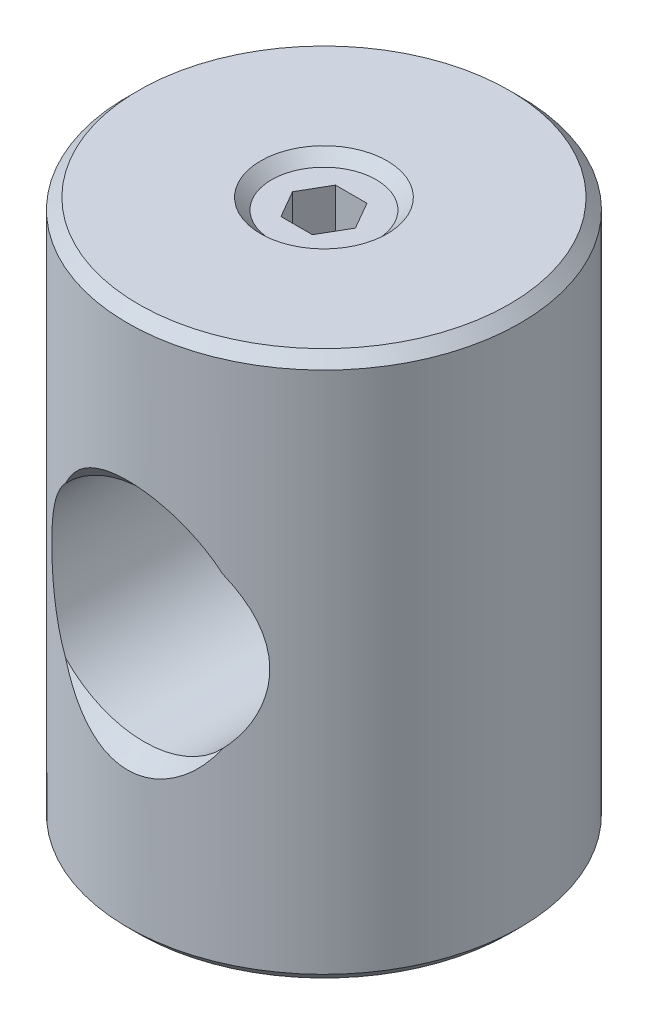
ISO-10303-21;
HEADER;
FILE_DESCRIPTION(('STEP AP214'),'2;1');
FILE_NAME('part.step','',(''),(''),'','','');
FILE_SCHEMA(('AUTOMOTIVE_DESIGN { 1 0 10303 214 1 1 1 1 }'));
ENDSEC;
DATA;
#1=APPLICATION_CONTEXT('core data for automotive mechanical design processes');
#2=APPLICATION_PROTOCOL_DEFINITION('international standard','automotive_design',2000,#1);
#3=PRODUCT_CONTEXT('',#1,'mechanical');
#4=PRODUCT('Part','Part','',(#3));
#5=PRODUCT_RELATED_PRODUCT_CATEGORY('part','',(#4));
#6=PRODUCT_DEFINITION_FORMATION('','',#4);
#7=PRODUCT_DEFINITION_CONTEXT('part definition',#1,'design');
#8=PRODUCT_DEFINITION('design','',#6,#7);
#9=PRODUCT_DEFINITION_SHAPE('','',#8);
#10=(LENGTH_UNIT() NAMED_UNIT(*) SI_UNIT(.MILLI.,.METRE.));
#11=(NAMED_UNIT(*) PLANE_ANGLE_UNIT() SI_UNIT($,.RADIAN.));
#12=(NAMED_UNIT(*) SI_UNIT($,.STERADIAN.) SOLID_ANGLE_UNIT());
#13=UNCERTAINTY_MEASURE_WITH_UNIT(LENGTH_MEASURE(1.E-05),#10,'distance_accuracy_value','');
#14=(GEOMETRIC_REPRESENTATION_CONTEXT(3) GLOBAL_UNCERTAINTY_ASSIGNED_CONTEXT((#13)) GLOBAL_UNIT_ASSIGNED_CONTEXT((#10,
#11,#12)) REPRESENTATION_CONTEXT('',''));
#15=CARTESIAN_POINT('',(0.,0.,0.));
#16=DIRECTION('',(0.,0.,1.));
#17=DIRECTION('',(1.,0.,0.));
#18=AXIS2_PLACEMENT_3D('',#15,#16,#17);
#19=CARTESIAN_POINT('',(0.,0.,9.));
#20=DIRECTION('',(0.,0.,1.));
#21=DIRECTION('',(0.,-1.,0.));
#22=AXIS2_PLACEMENT_3D('',#19,#20,#21);
#23=CONICAL_SURFACE('',#22,5.75,0.785398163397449);
#24=CARTESIAN_POINT('',(-3.40722866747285,3.76806941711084,8.33011361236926));
#25=CARTESIAN_POINT('',(-3.26870192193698,3.96972537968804,8.38677698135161));
#26=CARTESIAN_POINT('',(-3.11723360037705,4.16227904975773,8.44471771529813));
#27=CARTESIAN_POINT('',(-2.78821475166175,4.52410747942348,8.55897835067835));
#28=CARTESIAN_POINT('',(-2.6106900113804,4.69340493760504,8.61529978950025));
#29=CARTESIAN_POINT('',(-2.25043827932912,4.98567664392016,8.7158828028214));
#30=CARTESIAN_POINT('',(-2.07037119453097,5.11168517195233,8.76078982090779));
#31=CARTESIAN_POINT('',(-1.69081321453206,5.33448437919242,8.84186600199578));
#32=CARTESIAN_POINT('',(-1.49132925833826,5.43128544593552,8.87803827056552));
#33=CARTESIAN_POINT('',(-1.17960742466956,5.55011074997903,8.92299156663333));
#34=CARTESIAN_POINT('',(-1.07299234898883,5.58544398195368,8.93647340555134));
#35=CARTESIAN_POINT('',(-0.856628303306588,5.64627840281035,8.95979894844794));
#36=CARTESIAN_POINT('',(-0.746881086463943,5.67178498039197,8.96964464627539));
#37=CARTESIAN_POINT('',(-0.52526258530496,5.71234592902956,8.98534492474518));
#38=CARTESIAN_POINT('',(-0.413392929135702,5.72740800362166,8.99120244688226));
#39=CARTESIAN_POINT('',(-0.188626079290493,5.74673942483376,8.99872732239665));
#40=CARTESIAN_POINT('',(-0.075729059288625,5.75101056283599,9.00039537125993));
#41=CARTESIAN_POINT('',(0.228643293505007,5.74775527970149,8.99912252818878));
#42=CARTESIAN_POINT('',(0.420100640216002,5.72994437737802,8.99216407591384));
#43=CARTESIAN_POINT('',(0.796775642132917,5.66407886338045,8.96665582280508));
#44=CARTESIAN_POINT('',(0.981992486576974,5.61602033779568,8.94810452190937));
#45=CARTESIAN_POINT('',(1.33967644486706,5.49362948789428,8.90154133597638));
#46=CARTESIAN_POINT('',(1.51226779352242,5.41961250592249,8.87364317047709));
#47=CARTESIAN_POINT('',(1.84441910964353,5.24903655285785,8.81060555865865));
#48=CARTESIAN_POINT('',(2.00397153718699,5.15246466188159,8.77546196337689));
#49=CARTESIAN_POINT('',(2.38279978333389,4.88892063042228,8.6819736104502));
#50=CARTESIAN_POINT('',(2.59342556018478,4.7105413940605,8.62065271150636));
#51=CARTESIAN_POINT('',(2.98185224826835,4.32218767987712,8.49414433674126));
#52=CARTESIAN_POINT('',(3.15959084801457,4.11215456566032,8.42894982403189));
#53=CARTESIAN_POINT('',(3.48569959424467,3.66349802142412,8.2994728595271));
#54=CARTESIAN_POINT('',(3.63341011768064,3.42438615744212,8.23523483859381));
#55=CARTESIAN_POINT('',(3.89538735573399,2.92671775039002,8.11460334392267));
#56=CARTESIAN_POINT('',(4.0096586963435,2.66816390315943,8.05820878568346));
#57=CARTESIAN_POINT('',(4.16655897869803,2.24054701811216,7.97773097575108));
#58=CARTESIAN_POINT('',(4.21973219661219,2.07600822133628,7.94963431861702));
#59=CARTESIAN_POINT('',(4.31359793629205,1.74250584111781,7.89909676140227));
#60=CARTESIAN_POINT('',(4.35428903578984,1.5735417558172,7.87665650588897));
#61=CARTESIAN_POINT('',(4.42304677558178,1.2323325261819,7.83825284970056));
#62=CARTESIAN_POINT('',(4.45111265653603,1.06008718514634,7.82228983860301));
#63=CARTESIAN_POINT('',(4.49449739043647,0.713494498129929,7.79744322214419));
#64=CARTESIAN_POINT('',(4.50981672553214,0.539147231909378,7.78855934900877));
#65=CARTESIAN_POINT('',(4.52776542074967,0.186898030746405,7.77813937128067));
#66=CARTESIAN_POINT('',(4.53019682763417,0.00898255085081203,7.77671788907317));
#67=CARTESIAN_POINT('',(4.52182304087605,-0.346433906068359,7.78158974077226));
#68=CARTESIAN_POINT('',(4.51101747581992,-0.52393487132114,7.78788329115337));
#69=CARTESIAN_POINT('',(4.47622339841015,-0.87727340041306,7.80793350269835));
#70=CARTESIAN_POINT('',(4.45223039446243,-1.05311037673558,7.82169270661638));
#71=CARTESIAN_POINT('',(4.39117668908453,-1.4018022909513,7.85613083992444));
#72=CARTESIAN_POINT('',(4.3541161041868,-1.57465725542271,7.87680970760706));
#73=CARTESIAN_POINT('',(4.26763451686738,-1.91395027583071,7.92399459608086));
#74=CARTESIAN_POINT('',(4.21838464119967,-2.08044312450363,7.95041937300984));
#75=CARTESIAN_POINT('',(4.10739892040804,-2.40832712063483,8.00831892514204));
#76=CARTESIAN_POINT('',(4.04565781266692,-2.56971608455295,8.03979582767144));
#77=CARTESIAN_POINT('',(3.84177756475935,-3.04457280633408,8.14026149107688));
#78=CARTESIAN_POINT('',(3.68089495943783,-3.34907360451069,8.21533633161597));
#79=CARTESIAN_POINT('',(3.34019271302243,-3.87572271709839,8.35890516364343));
#80=CARTESIAN_POINT('',(3.16801638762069,-4.10313327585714,8.42640592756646));
#81=CARTESIAN_POINT('',(2.78828744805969,-4.52690500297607,8.5595425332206));
#82=CARTESIAN_POINT('',(2.58079652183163,-4.72331918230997,8.6251813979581));
#83=CARTESIAN_POINT('',(2.18521878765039,-5.03261612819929,8.73247503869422));
#84=CARTESIAN_POINT('',(2.00449227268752,-5.15422404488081,8.77609899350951));
#85=CARTESIAN_POINT('',(1.6243026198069,-5.36804684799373,8.8543249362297));
#86=CARTESIAN_POINT('',(1.424851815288,-5.46028090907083,8.88893280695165));
#87=CARTESIAN_POINT('',(1.11385945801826,-5.5722672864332,8.93143297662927));
#88=CARTESIAN_POINT('',(1.00761880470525,-5.6053077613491,8.944073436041));
#89=CARTESIAN_POINT('',(0.792240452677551,-5.66162479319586,8.96571457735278));
#90=CARTESIAN_POINT('',(0.68310435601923,-5.68490663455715,8.97471722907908));
#91=CARTESIAN_POINT('',(0.46293464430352,-5.72114246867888,8.9887622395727));
#92=CARTESIAN_POINT('',(0.351902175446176,-5.73410248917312,8.99380690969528));
#93=CARTESIAN_POINT('',(0.129037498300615,-5.74940459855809,8.99976686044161));
#94=CARTESIAN_POINT('',(0.0172054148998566,-5.75174831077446,9.00068277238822));
#95=CARTESIAN_POINT('',(-0.28479001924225,-5.74358074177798,8.9974955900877));
#96=CARTESIAN_POINT('',(-0.474741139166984,-5.72287192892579,8.98941062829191));
#97=CARTESIAN_POINT('',(-0.847994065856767,-5.6518108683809,8.96192279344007));
#98=CARTESIAN_POINT('',(-1.03129500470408,-5.60145476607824,8.94251844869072));
#99=CARTESIAN_POINT('',(-1.38685190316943,-5.4744794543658,8.8943132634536));
#100=CARTESIAN_POINT('',(-1.5591220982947,-5.39789493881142,8.86552483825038));
#101=CARTESIAN_POINT('',(-1.89033615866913,-5.22234242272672,8.80086239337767));
#102=CARTESIAN_POINT('',(-2.04927196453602,-5.12336101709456,8.76498413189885));
#103=CARTESIAN_POINT('',(-2.4276840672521,-4.85305944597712,8.66954664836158));
#104=CARTESIAN_POINT('',(-2.63818935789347,-4.67018326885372,8.60705584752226));
#105=CARTESIAN_POINT('',(-3.02567579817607,-4.27282290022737,8.4786291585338));
#106=CARTESIAN_POINT('',(-3.2025929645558,-4.05827973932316,8.41268699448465));
#107=CARTESIAN_POINT('',(-3.52637515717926,-3.60055850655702,8.28225230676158));
#108=CARTESIAN_POINT('',(-3.67257069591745,-3.35689480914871,8.21781489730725));
#109=CARTESIAN_POINT('',(-3.93082777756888,-2.85020074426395,8.09746418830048));
#110=CARTESIAN_POINT('',(-4.04289453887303,-2.58717334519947,8.04154958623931));
#111=CARTESIAN_POINT('',(-4.19529026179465,-2.15353669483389,7.96264238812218));
#112=CARTESIAN_POINT('',(-4.24647642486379,-1.98741993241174,7.93536566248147));
#113=CARTESIAN_POINT('',(-4.33623704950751,-1.65091843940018,7.88667685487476));
#114=CARTESIAN_POINT('',(-4.37481012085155,-1.48053324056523,7.86526541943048));
#115=CARTESIAN_POINT('',(-4.43919418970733,-1.13668161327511,7.82910707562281));
#116=CARTESIAN_POINT('',(-4.46500564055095,-0.963215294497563,7.81435993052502));
#117=CARTESIAN_POINT('',(-4.50375315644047,-0.614392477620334,7.79209276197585));
#118=CARTESIAN_POINT('',(-4.5166897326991,-0.439036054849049,7.78457245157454));
#119=CARTESIAN_POINT('',(-4.52967716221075,-0.0860892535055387,7.77702277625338));
#120=CARTESIAN_POINT('',(-4.5296100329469,0.0915069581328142,7.77706199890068));
#121=CARTESIAN_POINT('',(-4.51629570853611,0.446039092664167,7.78480129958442));
#122=CARTESIAN_POINT('',(-4.50304822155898,0.622975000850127,7.79250154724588));
#123=CARTESIAN_POINT('',(-4.46343122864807,0.975018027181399,7.81526082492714));
#124=CARTESIAN_POINT('',(-4.43705238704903,1.15012375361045,7.83032509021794));
#125=CARTESIAN_POINT('',(-4.3712904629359,1.4971454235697,7.86722555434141));
#126=CARTESIAN_POINT('',(-4.33190730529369,1.66906134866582,7.88906179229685));
#127=CARTESIAN_POINT('',(-4.23939267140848,2.01179113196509,7.93916671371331));
#128=CARTESIAN_POINT('',(-4.18601283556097,2.18252114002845,7.96755035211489));
#129=CARTESIAN_POINT('',(-4.06596398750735,2.51837278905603,8.02947682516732));
#130=CARTESIAN_POINT('',(-3.99928842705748,2.68349161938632,8.06302220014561));
#131=CARTESIAN_POINT('',(-3.85278037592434,3.00668812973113,8.13404591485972));
#132=CARTESIAN_POINT('',(-3.77296271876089,3.16477349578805,8.17151980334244));
#133=CARTESIAN_POINT('',(-3.6000784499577,3.47283699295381,8.24914595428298));
#134=CARTESIAN_POINT('',(-3.50701090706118,3.6228145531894,8.28929840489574));
#135=CARTESIAN_POINT('',(-3.40722866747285,3.76806941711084,8.33011361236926));
#136=B_SPLINE_CURVE_WITH_KNOTS('',3,(#24,#25,#26,#27,#28,#29,#30,#31,#32,#33,#34,#35,#36,#37,
#38,#39,#40,#41,#42,#43,#44,#45,#46,#47,#48,#49,#50,#51,#52,#53,#54,#55,#56,#57,#58,#59,#60,#61,
#62,#63,#64,#65,#66,#67,#68,#69,#70,#71,#72,#73,#74,#75,#76,#77,#78,#79,#80,#81,#82,#83,#84,#85,
#86,#87,#88,#89,#90,#91,#92,#93,#94,#95,#96,#97,#98,#99,#100,#101,#102,#103,#104,#105,#106,#107,
#108,#109,#110,#111,#112,#113,#114,#115,#116,#117,#118,#119,#120,#121,#122,#123,#124,#125,#126,
#127,#128,#129,#130,#131,#132,#133,#134,#135),.UNSPECIFIED.,.T.,.F.,(4,2,2,2,2,2,2,2,2,2,2,2,2,
2,2,2,2,2,2,2,2,2,2,2,2,2,2,2,2,2,2,2,2,2,2,2,2,2,2,2,2,2,2,2,2,2,2,2,2,2,2,2,2,2,2,4),(0.,
0.753007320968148,1.50527438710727,2.17582423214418,2.84613531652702,3.18506209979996,
3.52380275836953,3.86229330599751,4.20072765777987,4.77479571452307,5.34893806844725,
5.916334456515,6.48405666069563,7.32763210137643,8.17278985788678,9.03487760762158,
9.89684603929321,10.421882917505,10.9469795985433,11.4721078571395,11.9972162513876,
12.5303672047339,13.0635331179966,13.5968807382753,14.1302236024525,14.6564659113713,
15.1829303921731,16.2347988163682,17.1110924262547,17.9858707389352,18.6499859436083,
19.3136667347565,19.6491557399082,19.9844628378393,20.3195739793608,20.6546338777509,
21.2252862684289,21.7960128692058,22.3659874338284,22.9363040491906,23.7888997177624,
24.6431035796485,25.5143380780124,26.3854392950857,26.9127668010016,27.4401524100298,
27.9675192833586,28.4948652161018,29.0269959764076,29.5591385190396,30.0916599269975,
30.6241844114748,31.1668859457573,31.7098554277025,32.2522162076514,32.794615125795),.UNSPECIFIED.);
#137=CARTESIAN_POINT('',(3.59687364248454,-3.47311099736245,8.25));
#138=VERTEX_POINT('',#137);
#139=CARTESIAN_POINT('',(-3.59687364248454,-3.47311099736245,8.25));
#140=VERTEX_POINT('',#139);
#141=EDGE_CURVE('E178',#138,#140,#136,.T.);
#142=ORIENTED_EDGE('',*,*,#141,.F.);
#143=CARTESIAN_POINT('',(0.,0.,8.25));
#144=DIRECTION('',(0.,0.,1.));
#145=DIRECTION('',(1.,0.,0.));
#146=AXIS2_PLACEMENT_3D('',#143,#144,#145);
#147=CIRCLE('',#146,5.);
#148=EDGE_CURVE('E179',#138,#140,#147,.F.);
#149=ORIENTED_EDGE('',*,*,#148,.T.);
#150=EDGE_LOOP('',(#142,#149));
#151=FACE_BOUND('',#150,.T.);
#152=ADVANCED_FACE('F14',(#151),#23,.F.);
#153=CARTESIAN_POINT('',(0.,0.,-7.5));
#154=DIRECTION('',(0.,0.,-1.));
#155=DIRECTION('',(0.,1.,0.));
#156=AXIS2_PLACEMENT_3D('',#153,#154,#155);
#157=CONICAL_SURFACE('',#156,4.25,0.785398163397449);
#158=CARTESIAN_POINT('',(-3.40722866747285,3.76806941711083,-8.33011361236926));
#159=CARTESIAN_POINT('',(-3.60119076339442,3.48570695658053,-8.25078486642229));
#160=CARTESIAN_POINT('',(-3.77004962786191,3.18514788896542,-8.17388336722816));
#161=CARTESIAN_POINT('',(-3.98577196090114,2.71508621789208,-8.06969210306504));
#162=CARTESIAN_POINT('',(-4.05146063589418,2.55504217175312,-8.03679723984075));
#163=CARTESIAN_POINT('',(-4.17029897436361,2.22949729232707,-7.97578121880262));
#164=CARTESIAN_POINT('',(-4.22345428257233,2.06399895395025,-7.94765791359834));
#165=CARTESIAN_POINT('',(-4.3175181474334,1.72725430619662,-7.89695600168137));
#166=CARTESIAN_POINT('',(-4.35832329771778,1.55597212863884,-7.87442448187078));
#167=CARTESIAN_POINT('',(-4.42697605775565,1.21008395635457,-7.83603430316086));
#168=CARTESIAN_POINT('',(-4.45482355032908,1.03547793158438,-7.82017570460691));
#169=CARTESIAN_POINT('',(-4.49741585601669,0.684310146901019,-7.79575877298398));
#170=CARTESIAN_POINT('',(-4.51217119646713,0.50775007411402,-7.78719457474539));
#171=CARTESIAN_POINT('',(-4.52853818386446,0.15381815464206,-7.77768813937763));
#172=CARTESIAN_POINT('',(-4.53015007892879,-0.0235536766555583,-7.77674575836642));
#173=CARTESIAN_POINT('',(-4.52025539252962,-0.376589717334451,-7.78250103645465));
#174=CARTESIAN_POINT('',(-4.50883847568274,-0.552257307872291,-7.78914647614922));
#175=CARTESIAN_POINT('',(-4.47309415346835,-0.901841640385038,-7.80972804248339));
#176=CARTESIAN_POINT('',(-4.44876657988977,-1.07575835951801,-7.82366426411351));
#177=CARTESIAN_POINT('',(-4.38729161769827,-1.42075634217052,-7.85830230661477));
#178=CARTESIAN_POINT('',(-4.35013483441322,-1.59183543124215,-7.8790090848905));
#179=CARTESIAN_POINT('',(-4.26312282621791,-1.92994295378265,-7.92642645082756));
#180=CARTESIAN_POINT('',(-4.21326282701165,-2.09696983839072,-7.95313929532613));
#181=CARTESIAN_POINT('',(-4.10063711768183,-2.42674706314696,-8.01179314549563));
#182=CARTESIAN_POINT('',(-4.03780179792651,-2.58946876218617,-8.04376215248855));
#183=CARTESIAN_POINT('',(-3.89945641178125,-2.90857307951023,-8.11173016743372));
#184=CARTESIAN_POINT('',(-3.82394052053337,-3.06495274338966,-8.14773102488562));
#185=CARTESIAN_POINT('',(-3.57842831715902,-3.52261957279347,-8.25998495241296));
#186=CARTESIAN_POINT('',(-3.38926193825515,-3.81304554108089,-8.34060485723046));
#187=CARTESIAN_POINT('',(-3.01266338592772,-4.28570135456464,-8.48255197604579));
#188=CARTESIAN_POINT('',(-2.8363613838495,-4.47693024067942,-8.54372198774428));
#189=CARTESIAN_POINT('',(-2.45432395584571,-4.82917388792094,-8.6611799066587));
#190=CARTESIAN_POINT('',(-2.24863990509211,-4.99024027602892,-8.71747606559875));
#191=CARTESIAN_POINT('',(-1.85598304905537,-5.24321841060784,-8.8083430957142));
#192=CARTESIAN_POINT('',(-1.67428134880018,-5.34255189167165,-8.84498975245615));
#193=CARTESIAN_POINT('',(-1.29575769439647,-5.51171578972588,-8.90828792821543));
#194=CARTESIAN_POINT('',(-1.0989466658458,-5.58156729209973,-8.93494658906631));
#195=CARTESIAN_POINT('',(-0.79541812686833,-5.6607217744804,-8.965369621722));
#196=CARTESIAN_POINT('',(-0.692396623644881,-5.68287524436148,-8.9739323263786));
#197=CARTESIAN_POINT('',(-0.484589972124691,-5.71801012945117,-8.98754596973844));
#198=CARTESIAN_POINT('',(-0.379805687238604,-5.73099590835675,-8.99259857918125));
#199=CARTESIAN_POINT('',(-0.169394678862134,-5.74749275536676,-8.99902110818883));
#200=CARTESIAN_POINT('',(-0.0637680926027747,-5.75100533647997,-9.0003916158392));
#201=CARTESIAN_POINT('',(0.147321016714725,-5.74849720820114,-8.99941446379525));
#202=CARTESIAN_POINT('',(0.252783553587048,-5.74247735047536,-8.99706713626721));
#203=CARTESIAN_POINT('',(0.543014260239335,-5.71276980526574,-8.98550886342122));
#204=CARTESIAN_POINT('',(0.726702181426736,-5.67908613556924,-8.97241977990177));
#205=CARTESIAN_POINT('',(1.08571078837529,-5.58455150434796,-8.93610219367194));
#206=CARTESIAN_POINT('',(1.2610299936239,-5.52369575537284,-8.91287190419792));
#207=CARTESIAN_POINT('',(1.608020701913,-5.37487300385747,-8.8570074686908));
#208=CARTESIAN_POINT('',(1.77913869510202,-5.28577175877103,-8.82398453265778));
#209=CARTESIAN_POINT('',(2.10660619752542,-5.08579721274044,-8.75159473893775));
#210=CARTESIAN_POINT('',(2.26294500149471,-4.97490830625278,-8.71222333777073));
#211=CARTESIAN_POINT('',(2.63871390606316,-4.67157501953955,-8.60771969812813));
#212=CARTESIAN_POINT('',(2.84770083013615,-4.46704301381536,-8.53998835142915));
#213=CARTESIAN_POINT('',(3.2288192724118,-4.02640861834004,-8.40332608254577));
#214=CARTESIAN_POINT('',(3.40087960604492,-3.79024665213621,-8.33439311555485));
#215=CARTESIAN_POINT('',(3.71148095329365,-3.28933678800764,-8.20085213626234));
#216=CARTESIAN_POINT('',(3.84933102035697,-3.02413495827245,-8.13634979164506));
#217=CARTESIAN_POINT('',(4.08747861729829,-2.47494137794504,-8.01936290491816));
#218=CARTESIAN_POINT('',(4.18778807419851,-2.19095562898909,-7.96687454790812));
#219=CARTESIAN_POINT('',(4.31674144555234,-1.73045229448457,-7.89737916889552));
#220=CARTESIAN_POINT('',(4.35785782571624,-1.55816642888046,-7.87468226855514));
#221=CARTESIAN_POINT('',(4.42698539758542,-1.21018670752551,-7.83603157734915));
#222=CARTESIAN_POINT('',(4.45499539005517,-1.03449254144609,-7.82007840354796));
#223=CARTESIAN_POINT('',(4.49776383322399,-0.681004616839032,-7.79555806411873));
#224=CARTESIAN_POINT('',(4.5125231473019,-0.503210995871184,-7.7869904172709));
#225=CARTESIAN_POINT('',(4.52871521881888,-0.14681732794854,-7.77758502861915));
#226=CARTESIAN_POINT('',(4.5301485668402,0.0317826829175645,-7.77674694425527));
#227=CARTESIAN_POINT('',(4.51975220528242,0.386036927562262,-7.78279341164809));
#228=CARTESIAN_POINT('',(4.50810203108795,0.561698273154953,-7.78957342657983));
#229=CARTESIAN_POINT('',(4.47189079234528,0.911248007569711,-7.81041788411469));
#230=CARTESIAN_POINT('',(4.44732955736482,1.08513637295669,-7.82448242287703));
#231=CARTESIAN_POINT('',(4.38539293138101,1.43002442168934,-7.85936319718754));
#232=CARTESIAN_POINT('',(4.34801047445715,1.60102245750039,-7.88018315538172));
#233=CARTESIAN_POINT('',(4.26055182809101,1.93894874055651,-7.92781023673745));
#234=CARTESIAN_POINT('',(4.21047086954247,2.105875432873,-7.95461960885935));
#235=CARTESIAN_POINT('',(4.09739056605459,2.43547842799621,-8.01345599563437));
#236=CARTESIAN_POINT('',(4.03431818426,2.59812456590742,-8.04551228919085));
#237=CARTESIAN_POINT('',(3.8954946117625,2.91705558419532,-8.11363586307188));
#238=CARTESIAN_POINT('',(3.81973758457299,3.07333749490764,-8.1497049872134));
#239=CARTESIAN_POINT('',(3.57349016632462,3.53068122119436,-8.26213329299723));
#240=CARTESIAN_POINT('',(3.38381899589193,3.82084603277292,-8.34282816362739));
#241=CARTESIAN_POINT('',(3.00660990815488,4.29254596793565,-8.48470055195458));
#242=CARTESIAN_POINT('',(2.83026187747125,4.48315438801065,-8.54574339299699));
#243=CARTESIAN_POINT('',(2.44823400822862,4.83417203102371,-8.6629021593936));
#244=CARTESIAN_POINT('',(2.24260547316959,4.99463295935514,-8.7190264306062));
#245=CARTESIAN_POINT('',(1.85002614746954,5.24664531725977,-8.80959637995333));
#246=CARTESIAN_POINT('',(1.6683112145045,5.34559314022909,-8.84611687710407));
#247=CARTESIAN_POINT('',(1.28982452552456,5.51398430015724,-8.90914806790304));
#248=CARTESIAN_POINT('',(1.09306361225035,5.58344865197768,-8.93566588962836));
#249=CARTESIAN_POINT('',(0.789670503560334,5.66203710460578,-8.96587708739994));
#250=CARTESIAN_POINT('',(0.686706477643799,5.68400342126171,-8.97436871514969));
#251=CARTESIAN_POINT('',(0.479033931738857,5.7187745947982,-8.98784298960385));
#252=CARTESIAN_POINT('',(0.374326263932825,5.73158379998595,-8.99282730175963));
#253=CARTESIAN_POINT('',(0.16408764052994,5.74774225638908,-8.99911840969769));
#254=CARTESIAN_POINT('',(0.0585568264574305,5.75109309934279,-9.00042582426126));
#255=CARTESIAN_POINT('',(-0.152325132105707,5.74828036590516,-8.99932993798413));
#256=CARTESIAN_POINT('',(-0.257676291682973,5.74211763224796,-8.99692696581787));
#257=CARTESIAN_POINT('',(-0.547704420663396,5.71203256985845,-8.98522256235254));
#258=CARTESIAN_POINT('',(-0.731285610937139,5.67811796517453,-8.9720451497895));
#259=CARTESIAN_POINT('',(-1.09006528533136,5.5831592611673,-8.93557001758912));
#260=CARTESIAN_POINT('',(-1.26526168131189,5.52210844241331,-8.91226979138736));
#261=CARTESIAN_POINT('',(-1.61214674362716,5.37285918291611,-8.85625823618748));
#262=CARTESIAN_POINT('',(-1.7832693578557,5.28350459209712,-8.82315097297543));
#263=CARTESIAN_POINT('',(-2.11067694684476,5.08304893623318,-8.75061305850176));
#264=CARTESIAN_POINT('',(-2.26695545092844,4.97193845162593,-8.71117966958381));
#265=CARTESIAN_POINT('',(-2.6068439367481,4.69694842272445,-8.6164882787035));
#266=CARTESIAN_POINT('',(-2.78527044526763,4.5271041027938,-8.55995377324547));
#267=CARTESIAN_POINT('',(-3.11587685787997,4.16400984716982,-8.44523545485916));
#268=CARTESIAN_POINT('',(-3.26801836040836,3.97072635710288,-8.38704937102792));
#269=CARTESIAN_POINT('',(-3.40722866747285,3.76806941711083,-8.33011361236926));
#270=B_SPLINE_CURVE_WITH_KNOTS('',3,(#158,#159,#160,#161,#162,#163,#164,#165,#166,#167,#168,
#169,#170,#171,#172,#173,#174,#175,#176,#177,#178,#179,#180,#181,#182,#183,#184,#185,#186,#187,
#188,#189,#190,#191,#192,#193,#194,#195,#196,#197,#198,#199,#200,#201,#202,#203,#204,#205,#206,
#207,#208,#209,#210,#211,#212,#213,#214,#215,#216,#217,#218,#219,#220,#221,#222,#223,#224,#225,
#226,#227,#228,#229,#230,#231,#232,#233,#234,#235,#236,#237,#238,#239,#240,#241,#242,#243,#244,
#245,#246,#247,#248,#249,#250,#251,#252,#253,#254,#255,#256,#257,#258,#259,#260,#261,#262,#263,
#264,#265,#266,#267,#268,#269),.UNSPECIFIED.,.T.,.F.,(4,2,2,2,2,2,2,2,2,2,2,2,2,2,2,2,2,2,2,2,2,
2,2,2,2,2,2,2,2,2,2,2,2,2,2,2,2,2,2,2,2,2,2,2,2,2,2,2,2,2,2,2,2,2,2,4),(0.,1.05381112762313,
1.58166929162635,2.10928926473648,2.64121194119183,3.17313942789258,3.70463880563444,
4.2361281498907,4.76398171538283,5.29184215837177,5.8200899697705,6.34853660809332,
6.87989553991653,7.41149922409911,8.47276499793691,9.2716937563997,10.0692422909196,
10.6977847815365,11.3258769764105,11.6426522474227,11.9592766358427,12.2758504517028,
12.592395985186,13.1512135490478,13.7101296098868,14.2951696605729,14.8806302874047,
15.7761909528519,16.6734628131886,17.5876027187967,18.5014519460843,19.0366134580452,
19.571823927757,20.1069995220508,20.6421513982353,21.1700485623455,21.6979526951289,
22.2261482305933,22.7545424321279,23.2859925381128,23.8176878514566,24.8791547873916,
25.6767621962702,26.4729889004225,27.1009539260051,27.7284706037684,28.04494412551,
28.3612672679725,28.6775371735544,28.9937790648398,29.5524313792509,30.1112221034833,
30.6966702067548,31.282372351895,32.0376185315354,32.7939589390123),.UNSPECIFIED.);
#271=CARTESIAN_POINT('',(-3.59687364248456,-3.47311099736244,-8.25));
#272=VERTEX_POINT('',#271);
#273=CARTESIAN_POINT('',(3.59687364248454,-3.47311099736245,-8.25));
#274=VERTEX_POINT('',#273);
#275=EDGE_CURVE('E112',#272,#274,#270,.T.);
#276=ORIENTED_EDGE('',*,*,#275,.F.);
#277=CARTESIAN_POINT('',(0.,0.,-8.25));
#278=DIRECTION('',(0.,0.,-1.));
#279=DIRECTION('',(-1.,0.,0.));
#280=AXIS2_PLACEMENT_3D('',#277,#278,#279);
#281=CIRCLE('',#280,5.);
#282=EDGE_CURVE('E105',#272,#274,#281,.F.);
#283=ORIENTED_EDGE('',*,*,#282,.T.);
#284=EDGE_LOOP('',(#276,#283));
#285=FACE_BOUND('',#284,.T.);
#286=ADVANCED_FACE('F140',(#285),#157,.F.);
#287=CARTESIAN_POINT('',(0.,12.,0.));
#288=DIRECTION('',(0.,-1.,0.));
#289=DIRECTION('',(1.,0.,0.));
#290=AXIS2_PLACEMENT_3D('',#287,#288,#289);
#291=PLANE('',#290);
#292=DIRECTION('',(0.5,0.,0.866025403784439));
#293=VECTOR('',#292,1.);
#294=CARTESIAN_POINT('',(-1.44337567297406,12.,0.));
#295=LINE('',#294,#293);
#296=CARTESIAN_POINT('',(-1.44337567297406,12.,0.));
#297=VERTEX_POINT('',#296);
#298=CARTESIAN_POINT('',(-0.721687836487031,12.,1.25));
#299=VERTEX_POINT('',#298);
#300=EDGE_CURVE('E304',#297,#299,#295,.T.);
#301=ORIENTED_EDGE('',*,*,#300,.F.);
#302=DIRECTION('',(-0.5,0.,0.866025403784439));
#303=VECTOR('',#302,1.);
#304=CARTESIAN_POINT('',(-0.721687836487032,12.,-1.25));
#305=LINE('',#304,#303);
#306=CARTESIAN_POINT('',(-0.721687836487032,12.,-1.25));
#307=VERTEX_POINT('',#306);
#308=EDGE_CURVE('E191',#307,#297,#305,.T.);
#309=ORIENTED_EDGE('',*,*,#308,.F.);
#310=DIRECTION('',(-1.,0.,0.));
#311=VECTOR('',#310,1.);
#312=CARTESIAN_POINT('',(0.721687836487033,12.,-1.25));
#313=LINE('',#312,#311);
#314=CARTESIAN_POINT('',(0.721687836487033,12.,-1.25));
#315=VERTEX_POINT('',#314);
#316=EDGE_CURVE('E291',#315,#307,#313,.T.);
#317=ORIENTED_EDGE('',*,*,#316,.F.);
#318=DIRECTION('',(-0.5,0.,-0.866025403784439));
#319=VECTOR('',#318,1.);
#320=CARTESIAN_POINT('',(1.44337567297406,12.,0.));
#321=LINE('',#320,#319);
#322=CARTESIAN_POINT('',(1.44337567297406,12.,0.));
#323=VERTEX_POINT('',#322);
#324=EDGE_CURVE('E295',#323,#315,#321,.T.);
#325=ORIENTED_EDGE('',*,*,#324,.F.);
#326=DIRECTION('',(0.5,0.,-0.866025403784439));
#327=VECTOR('',#326,1.);
#328=CARTESIAN_POINT('',(0.721687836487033,12.,1.25));
#329=LINE('',#328,#327);
#330=CARTESIAN_POINT('',(0.721687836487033,12.,1.25));
#331=VERTEX_POINT('',#330);
#332=EDGE_CURVE('E298',#331,#323,#329,.T.);
#333=ORIENTED_EDGE('',*,*,#332,.F.);
#334=DIRECTION('',(1.,0.,0.));
#335=VECTOR('',#334,1.);
#336=CARTESIAN_POINT('',(-0.721687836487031,12.,1.25));
#337=LINE('',#336,#335);
#338=EDGE_CURVE('E301',#299,#331,#337,.T.);
#339=ORIENTED_EDGE('',*,*,#338,.F.);
#340=EDGE_LOOP('',(#301,#309,#317,#325,#333,#339));
#341=FACE_BOUND('',#340,.T.);
#342=CARTESIAN_POINT('',(0.,12.,0.));
#343=DIRECTION('',(0.,-1.,0.));
#344=DIRECTION('',(1.,0.,0.));
#345=AXIS2_PLACEMENT_3D('',#342,#343,#344);
#346=CIRCLE('',#345,2.4);
#347=CARTESIAN_POINT('',(2.4,12.,0.));
#348=VERTEX_POINT('',#347);
#349=EDGE_CURVE('E9',#348,#348,#346,.F.);
#350=ORIENTED_EDGE('',*,*,#349,.T.);
#351=EDGE_LOOP('',(#350));
#352=FACE_BOUND('',#351,.T.);
#353=ADVANCED_FACE('F164',(#341,#352),#291,.F.);
#354=CARTESIAN_POINT('',(-1.44337567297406,10.,0.));
#355=DIRECTION('',(0.,1.,0.));
#356=DIRECTION('',(-1.,0.,0.));
#357=AXIS2_PLACEMENT_3D('',#354,#355,#356);
#358=PLANE('',#357);
#359=DIRECTION('',(-0.5,0.,0.866025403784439));
#360=VECTOR('',#359,1.);
#361=CARTESIAN_POINT('',(-0.721687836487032,10.,-1.25));
#362=LINE('',#361,#360);
#363=CARTESIAN_POINT('',(-0.721687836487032,10.,-1.25));
#364=VERTEX_POINT('',#363);
#365=CARTESIAN_POINT('',(-1.44337567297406,10.,0.));
#366=VERTEX_POINT('',#365);
#367=EDGE_CURVE('E294',#364,#366,#362,.T.);
#368=ORIENTED_EDGE('',*,*,#367,.T.);
#369=DIRECTION('',(0.5,0.,0.866025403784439));
#370=VECTOR('',#369,1.);
#371=CARTESIAN_POINT('',(-1.44337567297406,10.,0.));
#372=LINE('',#371,#370);
#373=CARTESIAN_POINT('',(-0.721687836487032,10.,1.25));
#374=VERTEX_POINT('',#373);
#375=EDGE_CURVE('E318',#366,#374,#372,.T.);
#376=ORIENTED_EDGE('',*,*,#375,.T.);
#377=DIRECTION('',(1.,0.,0.));
#378=VECTOR('',#377,1.);
#379=CARTESIAN_POINT('',(-0.721687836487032,10.,1.25));
#380=LINE('',#379,#378);
#381=CARTESIAN_POINT('',(0.721687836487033,10.,1.25));
#382=VERTEX_POINT('',#381);
#383=EDGE_CURVE('E315',#374,#382,#380,.T.);
#384=ORIENTED_EDGE('',*,*,#383,.T.);
#385=DIRECTION('',(0.5,0.,-0.866025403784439));
#386=VECTOR('',#385,1.);
#387=CARTESIAN_POINT('',(0.721687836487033,10.,1.25));
#388=LINE('',#387,#386);
#389=CARTESIAN_POINT('',(1.44337567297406,10.,0.));
#390=VERTEX_POINT('',#389);
#391=EDGE_CURVE('E312',#382,#390,#388,.T.);
#392=ORIENTED_EDGE('',*,*,#391,.T.);
#393=DIRECTION('',(-0.5,0.,-0.866025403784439));
#394=VECTOR('',#393,1.);
#395=CARTESIAN_POINT('',(1.44337567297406,10.,0.));
#396=LINE('',#395,#394);
#397=CARTESIAN_POINT('',(0.721687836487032,10.,-1.25));
#398=VERTEX_POINT('',#397);
#399=EDGE_CURVE('E309',#390,#398,#396,.T.);
#400=ORIENTED_EDGE('',*,*,#399,.T.);
#401=DIRECTION('',(-1.,0.,0.));
#402=VECTOR('',#401,1.);
#403=CARTESIAN_POINT('',(0.721687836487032,10.,-1.25));
#404=LINE('',#403,#402);
#405=EDGE_CURVE('E284',#398,#364,#404,.T.);
#406=ORIENTED_EDGE('',*,*,#405,.T.);
#407=EDGE_LOOP('',(#368,#376,#384,#392,#400,#406));
#408=FACE_BOUND('',#407,.T.);
#409=ADVANCED_FACE('F219',(#408),#358,.T.);
#410=CARTESIAN_POINT('',(-0.721687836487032,10.,1.25));
#411=DIRECTION('',(0.,0.,1.));
#412=DIRECTION('',(1.,0.,0.));
#413=AXIS2_PLACEMENT_3D('',#410,#411,#412);
#414=PLANE('',#413);
#415=ORIENTED_EDGE('',*,*,#338,.T.);
#416=DIRECTION('',(0.,1.,0.));
#417=VECTOR('',#416,1.);
#418=CARTESIAN_POINT('',(0.721687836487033,10.,1.25));
#419=LINE('',#418,#417);
#420=EDGE_CURVE('E286',#382,#331,#419,.T.);
#421=ORIENTED_EDGE('',*,*,#420,.F.);
#422=ORIENTED_EDGE('',*,*,#383,.F.);
#423=DIRECTION('',(0.,1.,0.));
#424=VECTOR('',#423,1.);
#425=CARTESIAN_POINT('',(-0.721687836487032,10.,1.25));
#426=LINE('',#425,#424);
#427=EDGE_CURVE('E283',#374,#299,#426,.T.);
#428=ORIENTED_EDGE('',*,*,#427,.T.);
#429=EDGE_LOOP('',(#415,#421,#422,#428));
#430=FACE_BOUND('',#429,.T.);
#431=ADVANCED_FACE('F228',(#430),#414,.F.);
#432=CARTESIAN_POINT('',(0.721687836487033,10.,1.25));
#433=DIRECTION('',(0.866025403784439,0.,0.5));
#434=DIRECTION('',(0.5,0.,-0.866025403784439));
#435=AXIS2_PLACEMENT_3D('',#432,#433,#434);
#436=PLANE('',#435);
#437=ORIENTED_EDGE('',*,*,#332,.T.);
#438=DIRECTION('',(0.,1.,0.));
#439=VECTOR('',#438,1.);
#440=CARTESIAN_POINT('',(1.44337567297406,10.,0.));
#441=LINE('',#440,#439);
#442=EDGE_CURVE('E288',#390,#323,#441,.T.);
#443=ORIENTED_EDGE('',*,*,#442,.F.);
#444=ORIENTED_EDGE('',*,*,#391,.F.);
#445=ORIENTED_EDGE('',*,*,#420,.T.);
#446=EDGE_LOOP('',(#437,#443,#444,#445));
#447=FACE_BOUND('',#446,.T.);
#448=ADVANCED_FACE('F236',(#447),#436,.F.);
#449=CARTESIAN_POINT('',(1.44337567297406,10.,0.));
#450=DIRECTION('',(0.866025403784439,0.,-0.5));
#451=DIRECTION('',(-0.5,0.,-0.866025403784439));
#452=AXIS2_PLACEMENT_3D('',#449,#450,#451);
#453=PLANE('',#452);
#454=ORIENTED_EDGE('',*,*,#324,.T.);
#455=DIRECTION('',(0.,1.,0.));
#456=VECTOR('',#455,1.);
#457=CARTESIAN_POINT('',(0.721687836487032,10.,-1.25));
#458=LINE('',#457,#456);
#459=EDGE_CURVE('E277',#398,#315,#458,.T.);
#460=ORIENTED_EDGE('',*,*,#459,.F.);
#461=ORIENTED_EDGE('',*,*,#399,.F.);
#462=ORIENTED_EDGE('',*,*,#442,.T.);
#463=EDGE_LOOP('',(#454,#460,#461,#462));
#464=FACE_BOUND('',#463,.T.);
#465=ADVANCED_FACE('F453',(#464),#453,.F.);
#466=CARTESIAN_POINT('',(0.721687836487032,10.,-1.25));
#467=DIRECTION('',(0.,0.,-1.));
#468=DIRECTION('',(-1.,0.,0.));
#469=AXIS2_PLACEMENT_3D('',#466,#467,#468);
#470=PLANE('',#469);
#471=ORIENTED_EDGE('',*,*,#316,.T.);
#472=DIRECTION('',(0.,1.,0.));
#473=VECTOR('',#472,1.);
#474=CARTESIAN_POINT('',(-0.721687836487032,10.,-1.25));
#475=LINE('',#474,#473);
#476=EDGE_CURVE('E274',#364,#307,#475,.T.);
#477=ORIENTED_EDGE('',*,*,#476,.F.);
#478=ORIENTED_EDGE('',*,*,#405,.F.);
#479=ORIENTED_EDGE('',*,*,#459,.T.);
#480=EDGE_LOOP('',(#471,#477,#478,#479));
#481=FACE_BOUND('',#480,.T.);
#482=ADVANCED_FACE('F251',(#481),#470,.F.);
#483=CARTESIAN_POINT('',(-0.721687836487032,10.,-1.25));
#484=DIRECTION('',(-0.866025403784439,0.,-0.5));
#485=DIRECTION('',(-0.5,0.,0.866025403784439));
#486=AXIS2_PLACEMENT_3D('',#483,#484,#485);
#487=PLANE('',#486);
#488=ORIENTED_EDGE('',*,*,#308,.T.);
#489=DIRECTION('',(0.,1.,0.));
#490=VECTOR('',#489,1.);
#491=CARTESIAN_POINT('',(-1.44337567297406,10.,0.));
#492=LINE('',#491,#490);
#493=EDGE_CURVE('E280',#366,#297,#492,.T.);
#494=ORIENTED_EDGE('',*,*,#493,.F.);
#495=ORIENTED_EDGE('',*,*,#367,.F.);
#496=ORIENTED_EDGE('',*,*,#476,.T.);
#497=EDGE_LOOP('',(#488,#494,#495,#496));
#498=FACE_BOUND('',#497,.T.);
#499=ADVANCED_FACE('F241',(#498),#487,.F.);
#500=CARTESIAN_POINT('',(-1.44337567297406,10.,0.));
#501=DIRECTION('',(-0.866025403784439,0.,0.5));
#502=DIRECTION('',(0.5,0.,0.866025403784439));
#503=AXIS2_PLACEMENT_3D('',#500,#501,#502);
#504=PLANE('',#503);
#505=ORIENTED_EDGE('',*,*,#300,.T.);
#506=ORIENTED_EDGE('',*,*,#427,.F.);
#507=ORIENTED_EDGE('',*,*,#375,.F.);
#508=ORIENTED_EDGE('',*,*,#493,.T.);
#509=EDGE_LOOP('',(#505,#506,#507,#508));
#510=FACE_BOUND('',#509,.T.);
#511=ADVANCED_FACE('F151',(#510),#504,.F.);
#512=CARTESIAN_POINT('',(0.,-12.5,0.));
#513=DIRECTION('',(0.,-1.,0.));
#514=DIRECTION('',(1.,0.,0.));
#515=AXIS2_PLACEMENT_3D('',#512,#513,#514);
#516=PLANE('',#515);
#517=CARTESIAN_POINT('',(0.,-12.5,0.));
#518=DIRECTION('',(0.,-1.,0.));
#519=DIRECTION('',(1.,0.,0.));
#520=AXIS2_PLACEMENT_3D('',#517,#518,#519);
#521=CIRCLE('',#520,8.5);
#522=CARTESIAN_POINT('',(8.5,-12.5,0.));
#523=VERTEX_POINT('',#522);
#524=EDGE_CURVE('E115',#523,#523,#521,.T.);
#525=ORIENTED_EDGE('',*,*,#524,.T.);
#526=EDGE_LOOP('',(#525));
#527=FACE_BOUND('',#526,.T.);
#528=ADVANCED_FACE('F148',(#527),#516,.T.);
#529=CARTESIAN_POINT('',(0.,-12.5,0.));
#530=DIRECTION('',(0.,1.,0.));
#531=DIRECTION('',(-1.,0.,0.));
#532=AXIS2_PLACEMENT_3D('',#529,#530,#531);
#533=CONICAL_SURFACE('',#532,8.5,0.785398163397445);
#534=CARTESIAN_POINT('',(0.,-12.,0.));
#535=DIRECTION('',(0.,-1.,0.));
#536=DIRECTION('',(1.,0.,0.));
#537=AXIS2_PLACEMENT_3D('',#534,#535,#536);
#538=CIRCLE('',#537,9.);
#539=CARTESIAN_POINT('',(9.,-12.,0.));
#540=VERTEX_POINT('',#539);
#541=EDGE_CURVE('E324',#540,#540,#538,.F.);
#542=ORIENTED_EDGE('',*,*,#541,.F.);
#543=EDGE_LOOP('',(#542));
#544=FACE_BOUND('',#543,.T.);
#545=ORIENTED_EDGE('',*,*,#524,.F.);
#546=EDGE_LOOP('',(#545));
#547=FACE_BOUND('',#546,.T.);
#548=ADVANCED_FACE('F150',(#544,#547),#533,.T.);
#549=CARTESIAN_POINT('',(0.,-12.5,0.));
#550=DIRECTION('',(0.,1.,0.));
#551=DIRECTION('',(-1.,0.,0.));
#552=AXIS2_PLACEMENT_3D('',#549,#550,#551);
#553=CYLINDRICAL_SURFACE('',#552,9.);
#554=ORIENTED_EDGE('',*,*,#141,.T.);
#555=CARTESIAN_POINT('',(5.,0.,7.48331477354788));
#556=CARTESIAN_POINT('',(5.00000168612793,-0.127928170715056,7.48331243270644));
#557=CARTESIAN_POINT('',(4.99508455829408,-0.255838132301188,7.48660574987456));
#558=CARTESIAN_POINT('',(4.97549919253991,-0.510621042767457,7.49963659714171));
#559=CARTESIAN_POINT('',(4.96082793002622,-0.637493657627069,7.50937612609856));
#560=CARTESIAN_POINT('',(4.92193111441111,-0.889291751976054,7.53492756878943));
#561=CARTESIAN_POINT('',(4.89769452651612,-1.01421480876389,7.55074649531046));
#562=CARTESIAN_POINT('',(4.84001097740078,-1.26110748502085,7.58784959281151));
#563=CARTESIAN_POINT('',(4.80655987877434,-1.38307575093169,7.60913621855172));
#564=CARTESIAN_POINT('',(4.69348469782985,-1.74173874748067,7.67978574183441));
#565=CARTESIAN_POINT('',(4.60083768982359,-1.97308729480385,7.7361492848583));
#566=CARTESIAN_POINT('',(4.3841201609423,-2.41673416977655,7.8609828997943));
#567=CARTESIAN_POINT('',(4.26004266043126,-2.62902825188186,7.92945565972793));
#568=CARTESIAN_POINT('',(3.96900941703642,-3.05281452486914,8.07938439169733));
#569=CARTESIAN_POINT('',(3.79894853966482,-3.26195895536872,8.16145087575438));
#570=CARTESIAN_POINT('',(3.42703633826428,-3.65072087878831,8.32445651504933));
#571=CARTESIAN_POINT('',(3.22516569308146,-3.83032028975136,8.40539495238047));
#572=CARTESIAN_POINT('',(2.89167020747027,-4.08166010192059,8.5237245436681));
#573=CARTESIAN_POINT('',(2.76990775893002,-4.16527912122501,8.56416494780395));
#574=CARTESIAN_POINT('',(2.51863299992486,-4.32184858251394,8.64139626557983));
#575=CARTESIAN_POINT('',(2.38912387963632,-4.39480337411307,8.67818866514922));
#576=CARTESIAN_POINT('',(2.12315988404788,-4.52928174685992,8.74706012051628));
#577=CARTESIAN_POINT('',(1.98670747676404,-4.59080935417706,8.77914083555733));
#578=CARTESIAN_POINT('',(1.70777533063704,-4.70170358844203,8.83763516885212));
#579=CARTESIAN_POINT('',(1.56529641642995,-4.75107187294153,8.86404955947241));
#580=CARTESIAN_POINT('',(1.2877293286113,-4.83331159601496,8.9084121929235));
#581=CARTESIAN_POINT('',(1.15303346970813,-4.86722427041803,8.92688709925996));
#582=CARTESIAN_POINT('',(0.880630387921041,-4.9238028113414,8.95786090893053));
#583=CARTESIAN_POINT('',(0.742923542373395,-4.94647007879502,8.97036055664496));
#584=CARTESIAN_POINT('',(0.465755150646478,-4.98021596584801,8.98901292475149));
#585=CARTESIAN_POINT('',(0.326294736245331,-4.99130170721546,8.99516954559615));
#586=CARTESIAN_POINT('',(0.0468047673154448,-5.00173570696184,9.00096328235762));
#587=CARTESIAN_POINT('',(-0.0932247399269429,-5.00108492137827,9.00060092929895));
#588=CARTESIAN_POINT('',(-0.357589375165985,-4.98875939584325,8.99375897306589));
#589=CARTESIAN_POINT('',(-0.481999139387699,-4.97827281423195,8.98793869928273));
#590=CARTESIAN_POINT('',(-0.729391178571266,-4.94808268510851,8.97125208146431));
#591=CARTESIAN_POINT('',(-0.852373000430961,-4.92837628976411,8.96038417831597));
#592=CARTESIAN_POINT('',(-1.0959879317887,-4.87998186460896,8.933857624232));
#593=CARTESIAN_POINT('',(-1.21662181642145,-4.85129685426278,8.91820058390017));
#594=CARTESIAN_POINT('',(-1.45483863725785,-4.78526368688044,8.88245387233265));
#595=CARTESIAN_POINT('',(-1.57242037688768,-4.74791218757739,8.86236249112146));
#596=CARTESIAN_POINT('',(-1.92181762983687,-4.62256700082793,8.79562517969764));
#597=CARTESIAN_POINT('',(-2.1480017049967,-4.52174175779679,8.74277577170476));
#598=CARTESIAN_POINT('',(-2.58053930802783,-4.28966562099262,8.62503641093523));
#599=CARTESIAN_POINT('',(-2.78688657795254,-4.1584051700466,8.5601426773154));
#600=CARTESIAN_POINT('',(-3.1981805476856,-3.8528159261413,8.415706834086));
#601=CARTESIAN_POINT('',(-3.40051176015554,-3.67534870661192,8.33533893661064));
#602=CARTESIAN_POINT('',(-3.77407432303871,-3.29066269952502,8.17300182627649));
#603=CARTESIAN_POINT('',(-3.94527235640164,-3.08341245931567,8.09103100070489));
#604=CARTESIAN_POINT('',(-4.26734084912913,-2.62215879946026,7.92624804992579));
#605=CARTESIAN_POINT('',(-4.41495784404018,-2.36561956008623,7.84403433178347));
#606=CARTESIAN_POINT('',(-4.60165722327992,-1.96133795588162,7.73498351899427));
#607=CARTESIAN_POINT('',(-4.658109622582,-1.82330564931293,7.70100676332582));
#608=CARTESIAN_POINT('',(-4.7587758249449,-1.54155222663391,7.63921059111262));
#609=CARTESIAN_POINT('',(-4.80299800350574,-1.39783508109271,7.61138696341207));
#610=CARTESIAN_POINT('',(-4.87549794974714,-1.11748986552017,7.5651320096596));
#611=CARTESIAN_POINT('',(-4.90476696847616,-0.981212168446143,7.54612808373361));
#612=CARTESIAN_POINT('',(-4.95187815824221,-0.705959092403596,7.51529770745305));
#613=CARTESIAN_POINT('',(-4.96972705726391,-0.56698535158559,7.50346703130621));
#614=CARTESIAN_POINT('',(-4.99368227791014,-0.287692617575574,7.48754609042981));
#615=CARTESIAN_POINT('',(-4.99979765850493,-0.14737474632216,7.48344985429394));
#616=CARTESIAN_POINT('',(-5.00019240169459,0.133275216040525,7.48318633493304));
#617=CARTESIAN_POINT('',(-4.99447312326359,0.273607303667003,7.48701814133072));
#618=CARTESIAN_POINT('',(-4.97305608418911,0.531875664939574,7.50125622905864));
#619=CARTESIAN_POINT('',(-4.95898586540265,0.650010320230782,7.5105887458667));
#620=CARTESIAN_POINT('',(-4.92258085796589,0.884473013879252,7.534498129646));
#621=CARTESIAN_POINT('',(-4.90024356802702,1.00080049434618,7.54907658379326));
#622=CARTESIAN_POINT('',(-4.8212053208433,1.3459518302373,7.59999895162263));
#623=CARTESIAN_POINT('',(-4.75246638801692,1.57107992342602,7.64353818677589));
#624=CARTESIAN_POINT('',(-4.58221724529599,2.01553201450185,7.74683834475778));
#625=CARTESIAN_POINT('',(-4.4794722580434,2.23423359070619,7.80719429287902));
#626=CARTESIAN_POINT('',(-4.24511762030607,2.65263979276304,7.93705962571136));
#627=CARTESIAN_POINT('',(-4.11349388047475,2.85233507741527,8.00657347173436));
#628=CARTESIAN_POINT('',(-3.80034784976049,3.26097955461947,8.16042346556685));
#629=CARTESIAN_POINT('',(-3.61419416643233,3.46617045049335,8.2453341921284));
#630=CARTESIAN_POINT('',(-3.20937434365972,3.8440219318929,8.41116341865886));
#631=CARTESIAN_POINT('',(-2.99068826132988,4.01666241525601,8.49207942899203));
#632=CARTESIAN_POINT('',(-2.63516774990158,4.25177528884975,8.60654459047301));
#633=CARTESIAN_POINT('',(-2.50847277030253,4.3277627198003,8.64441160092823));
#634=CARTESIAN_POINT('',(-2.24791423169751,4.46864465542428,8.71579527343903));
#635=CARTESIAN_POINT('',(-2.11405391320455,4.53354411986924,8.74931387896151));
#636=CARTESIAN_POINT('',(-1.84011344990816,4.65147414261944,8.81099820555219));
#637=CARTESIAN_POINT('',(-1.70003709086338,4.70451180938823,8.83916713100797));
#638=CARTESIAN_POINT('',(-1.41468037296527,4.7980423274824,8.88929967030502));
#639=CARTESIAN_POINT('',(-1.26940080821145,4.83853708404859,8.91126422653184));
#640=CARTESIAN_POINT('',(-0.990072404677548,4.90287043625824,8.94636750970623));
#641=CARTESIAN_POINT('',(-0.856402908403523,4.92799270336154,8.96018108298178));
#642=CARTESIAN_POINT('',(-0.586991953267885,4.96728957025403,8.98185367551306));
#643=CARTESIAN_POINT('',(-0.451250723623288,4.98146537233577,8.98971334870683));
#644=CARTESIAN_POINT('',(-0.178906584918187,4.99865996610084,8.99925276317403));
#645=CARTESIAN_POINT('',(-0.0423040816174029,5.00168366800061,9.00093522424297));
#646=CARTESIAN_POINT('',(0.230619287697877,4.99654304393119,8.99807967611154));
#647=CARTESIAN_POINT('',(0.366940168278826,4.98837931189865,8.99354199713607));
#648=CARTESIAN_POINT('',(0.625569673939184,4.96225300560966,8.97907835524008));
#649=CARTESIAN_POINT('',(0.748008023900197,4.94526668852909,8.96968964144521));
#650=CARTESIAN_POINT('',(0.990858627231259,4.90239002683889,8.94612300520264));
#651=CARTESIAN_POINT('',(1.11127023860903,4.87649691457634,8.93194359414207));
#652=CARTESIAN_POINT('',(1.46820122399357,4.78586534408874,8.88267195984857));
#653=CARTESIAN_POINT('',(1.70064180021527,4.70815134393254,8.84083292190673));
#654=CARTESIAN_POINT('',(2.15633419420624,4.51810507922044,8.74108400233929));
#655=CARTESIAN_POINT('',(2.37903324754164,4.40471936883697,8.68269129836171));
#656=CARTESIAN_POINT('',(2.80296262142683,4.1478778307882,8.5552586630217));
#657=CARTESIAN_POINT('',(3.00418443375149,4.00441015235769,8.48621453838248));
#658=CARTESIAN_POINT('',(3.40438344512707,3.67224716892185,8.33433239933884));
#659=CARTESIAN_POINT('',(3.60037215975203,3.48023099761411,8.25082429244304));
#660=CARTESIAN_POINT('',(3.8690336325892,3.17007268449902,8.12652435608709));
#661=CARTESIAN_POINT('',(3.95443792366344,3.06288246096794,8.08521168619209));
#662=CARTESIAN_POINT('',(4.11642028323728,2.84145897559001,8.00395385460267));
#663=CARTESIAN_POINT('',(4.19299678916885,2.72722447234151,7.96400893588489));
#664=CARTESIAN_POINT('',(4.34192328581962,2.48384412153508,7.88386707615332));
#665=CARTESIAN_POINT('',(4.41358524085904,2.35421559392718,7.84385429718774));
#666=CARTESIAN_POINT('',(4.54551236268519,2.08814528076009,7.7681465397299));
#667=CARTESIAN_POINT('',(4.60578326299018,1.95170696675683,7.73244939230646));
#668=CARTESIAN_POINT('',(4.7141322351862,1.6730930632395,7.66687445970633));
#669=CARTESIAN_POINT('',(4.76223904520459,1.53093193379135,7.63698299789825));
#670=CARTESIAN_POINT('',(4.84569782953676,1.24171103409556,7.58430305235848));
#671=CARTESIAN_POINT('',(4.88105782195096,1.09465440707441,7.56151010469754));
#672=CARTESIAN_POINT('',(4.93958350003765,0.790827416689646,7.52341637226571));
#673=CARTESIAN_POINT('',(4.96219291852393,0.633905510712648,7.5084591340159));
#674=CARTESIAN_POINT('',(4.99239972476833,0.317979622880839,7.48841004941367));
#675=CARTESIAN_POINT('',(4.99999790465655,0.158975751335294,7.48331768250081));
#676=CARTESIAN_POINT('',(5.,0.,7.48331477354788));
#677=B_SPLINE_CURVE_WITH_KNOTS('',3,(#555,#556,#557,#558,#559,#560,#561,#562,#563,#564,#565,
#566,#567,#568,#569,#570,#571,#572,#573,#574,#575,#576,#577,#578,#579,#580,#581,#582,#583,#584,
#585,#586,#587,#588,#589,#590,#591,#592,#593,#594,#595,#596,#597,#598,#599,#600,#601,#602,#603,
#604,#605,#606,#607,#608,#609,#610,#611,#612,#613,#614,#615,#616,#617,#618,#619,#620,#621,#622,
#623,#624,#625,#626,#627,#628,#629,#630,#631,#632,#633,#634,#635,#636,#637,#638,#639,#640,#641,
#642,#643,#644,#645,#646,#647,#648,#649,#650,#651,#652,#653,#654,#655,#656,#657,#658,#659,#660,
#661,#662,#663,#664,#665,#666,#667,#668,#669,#670,#671,#672,#673,#674,#675,#676),.UNSPECIFIED.,
.T.,.F.,(4,2,2,2,2,2,2,2,2,2,2,2,2,2,2,2,2,2,2,2,2,2,2,2,2,2,2,2,2,2,2,2,2,2,2,2,2,2,2,2,2,2,2,
2,2,2,2,2,2,2,2,2,2,2,2,2,2,2,2,2,4),(0.,0.383617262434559,0.767353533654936,1.15153379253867,
1.53588683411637,2.29887381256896,3.06203037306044,3.90401345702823,4.74650994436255,
5.20543330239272,5.66416895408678,6.12274267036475,6.58125383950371,7.00103463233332,
7.42076311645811,7.84023334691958,8.25966940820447,8.63418281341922,9.00881197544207,
9.38331528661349,9.75796326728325,10.5142082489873,11.2706910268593,12.1098131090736,
12.9498279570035,13.8660549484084,14.3243316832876,14.782293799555,15.2036849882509,
15.6248276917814,16.0456451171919,16.4664142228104,16.8239929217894,17.1816798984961,
17.8966505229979,18.6411117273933,19.3859369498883,20.2516469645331,21.1178898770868,
21.5748932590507,22.0316916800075,22.4882156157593,22.9446701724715,23.3542362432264,
23.7637573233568,24.1730980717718,24.5824170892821,24.9538736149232,25.3254456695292,
26.0679180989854,26.834783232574,27.6019510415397,28.4584307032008,28.8875063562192,
29.3166578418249,29.7763339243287,30.2357780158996,30.6941262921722,31.1521857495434,
31.6289303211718,32.105649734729),.UNSPECIFIED.);
#678=CARTESIAN_POINT('',(-3.59687364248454,3.47311099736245,8.25));
#679=VERTEX_POINT('',#678);
#680=EDGE_CURVE('E185',#140,#679,#677,.T.);
#681=ORIENTED_EDGE('',*,*,#680,.T.);
#682=CARTESIAN_POINT('',(3.59687364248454,3.47311099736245,8.25));
#683=VERTEX_POINT('',#682);
#684=EDGE_CURVE('E117',#679,#683,#136,.T.);
#685=ORIENTED_EDGE('',*,*,#684,.T.);
#686=EDGE_CURVE('E36',#683,#138,#677,.T.);
#687=ORIENTED_EDGE('',*,*,#686,.T.);
#688=EDGE_LOOP('',(#554,#681,#685,#687));
#689=FACE_BOUND('',#688,.T.);
#690=CARTESIAN_POINT('',(3.59687364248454,3.47311099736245,-8.25));
#691=VERTEX_POINT('',#690);
#692=CARTESIAN_POINT('',(-3.59687364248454,3.47311099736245,-8.25));
#693=VERTEX_POINT('',#692);
#694=EDGE_CURVE('E110',#691,#693,#270,.T.);
#695=ORIENTED_EDGE('',*,*,#694,.T.);
#696=CARTESIAN_POINT('',(0.,5.,-9.));
#697=CARTESIAN_POINT('',(-0.129728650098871,5.00000040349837,-9.00000035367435));
#698=CARTESIAN_POINT('',(-0.259452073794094,4.99494572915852,-8.99718916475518));
#699=CARTESIAN_POINT('',(-0.517921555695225,4.9747929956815,-8.98601661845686));
#700=CARTESIAN_POINT('',(-0.646667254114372,4.95969140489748,-8.97765330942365));
#701=CARTESIAN_POINT('',(-0.902114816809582,4.91964430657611,-8.955591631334));
#702=CARTESIAN_POINT('',(-1.02881719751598,4.89470132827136,-8.94189463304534));
#703=CARTESIAN_POINT('',(-1.27935747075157,4.83526936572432,-8.90950110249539));
#704=CARTESIAN_POINT('',(-1.40319416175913,4.80077645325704,-8.89080251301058));
#705=CARTESIAN_POINT('',(-1.64664425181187,4.72279881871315,-8.8489406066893));
#706=CARTESIAN_POINT('',(-1.76627303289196,4.67935197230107,-8.82579612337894));
#707=CARTESIAN_POINT('',(-2.00118015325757,4.58381684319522,-8.77551906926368));
#708=CARTESIAN_POINT('',(-2.1164568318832,4.53172530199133,-8.74838499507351));
#709=CARTESIAN_POINT('',(-2.45478877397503,4.36318845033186,-8.6618736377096));
#710=CARTESIAN_POINT('',(-2.67053417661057,4.23441988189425,-8.59735346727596));
#711=CARTESIAN_POINT('',(-3.09271229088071,3.93780768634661,-8.45507241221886));
#712=CARTESIAN_POINT('',(-3.29745415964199,3.76786951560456,-8.37670278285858));
#713=CARTESIAN_POINT('',(-3.67715998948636,3.39835387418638,-8.21711406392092));
#714=CARTESIAN_POINT('',(-3.85209353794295,3.19874651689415,-8.13589216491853));
#715=CARTESIAN_POINT('',(-4.18516795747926,2.75130582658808,-7.97009263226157));
#716=CARTESIAN_POINT('',(-4.33981028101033,2.50063516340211,-7.88600912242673));
#717=CARTESIAN_POINT('',(-4.53792036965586,2.10454112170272,-7.77258662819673));
#718=CARTESIAN_POINT('',(-4.59831134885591,1.96917342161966,-7.73689861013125));
#719=CARTESIAN_POINT('',(-4.70719976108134,1.69244684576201,-7.67113380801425));
#720=CARTESIAN_POINT('',(-4.75570081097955,1.55108980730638,-7.64105531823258));
#721=CARTESIAN_POINT('',(-4.86451848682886,1.17999431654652,-7.57250099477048));
#722=CARTESIAN_POINT('',(-4.9154532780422,0.946409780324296,-7.53922489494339));
#723=CARTESIAN_POINT('',(-4.98336969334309,0.472499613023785,-7.49451395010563));
#724=CARTESIAN_POINT('',(-5.0003847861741,0.232180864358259,-7.48305757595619));
#725=CARTESIAN_POINT('',(-4.99960164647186,-0.248654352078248,-7.48358103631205));
#726=CARTESIAN_POINT('',(-4.98176529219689,-0.489170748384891,-7.49558653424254));
#727=CARTESIAN_POINT('',(-4.91220969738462,-0.963158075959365,-7.54134329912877));
#728=CARTESIAN_POINT('',(-4.8604684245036,-1.19662432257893,-7.57510870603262));
#729=CARTESIAN_POINT('',(-4.725553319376,-1.65086354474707,-7.65998850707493));
#730=CARTESIAN_POINT('',(-4.64237249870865,-1.87163368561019,-7.71110675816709));
#731=CARTESIAN_POINT('',(-4.447403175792,-2.29681665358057,-7.82517266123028));
#732=CARTESIAN_POINT('',(-4.33560350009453,-2.50122305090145,-7.88812493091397));
#733=CARTESIAN_POINT('',(-4.06693738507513,-2.92082028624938,-8.03034742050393));
#734=CARTESIAN_POINT('',(-3.90580419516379,-3.13292950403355,-8.11064361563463));
#735=CARTESIAN_POINT('',(-3.55190169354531,-3.52909892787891,-8.27174396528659));
#736=CARTESIAN_POINT('',(-3.35910741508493,-3.7131367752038,-8.35254847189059));
#737=CARTESIAN_POINT('',(-3.0382033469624,-3.97377961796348,-8.47255594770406));
#738=CARTESIAN_POINT('',(-2.91988181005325,-4.06153890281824,-8.51415799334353));
#739=CARTESIAN_POINT('',(-2.67521853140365,-4.22669686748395,-8.59416899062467));
#740=CARTESIAN_POINT('',(-2.54887988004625,-4.30409950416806,-8.63257915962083));
#741=CARTESIAN_POINT('',(-2.28891079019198,-4.44780208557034,-8.70511911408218));
#742=CARTESIAN_POINT('',(-2.15528226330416,-4.51410492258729,-8.73925001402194));
#743=CARTESIAN_POINT('',(-1.88158110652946,-4.63486956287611,-8.8022360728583));
#744=CARTESIAN_POINT('',(-1.74150926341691,-4.68933280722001,-8.83109187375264));
#745=CARTESIAN_POINT('',(-1.46611496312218,-4.78227003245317,-8.88080389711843));
#746=CARTESIAN_POINT('',(-1.33115857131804,-4.82160315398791,-8.90208189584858));
#747=CARTESIAN_POINT('',(-1.05765459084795,-4.88888456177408,-8.9387020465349));
#748=CARTESIAN_POINT('',(-0.919107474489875,-4.91683433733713,-8.95404497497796));
#749=CARTESIAN_POINT('',(-0.639688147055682,-4.96092635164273,-8.97833234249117));
#750=CARTESIAN_POINT('',(-0.49881761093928,-4.97707674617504,-8.98728120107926));
#751=CARTESIAN_POINT('',(-0.215954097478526,-4.99734561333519,-8.99852157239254));
#752=CARTESIAN_POINT('',(-0.0739612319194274,-5.00146526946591,-9.00081373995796));
#753=CARTESIAN_POINT('',(0.193661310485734,-4.99783122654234,-8.99879540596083));
#754=CARTESIAN_POINT('',(0.319316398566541,-4.99137388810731,-8.99520578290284));
#755=CARTESIAN_POINT('',(0.569568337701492,-4.96904196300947,-8.98283315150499));
#756=CARTESIAN_POINT('',(0.694164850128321,-4.9531644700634,-8.97404854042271));
#757=CARTESIAN_POINT('',(0.941327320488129,-4.91218729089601,-8.95149651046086));
#758=CARTESIAN_POINT('',(1.06389401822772,-4.88709104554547,-8.93773095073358));
#759=CARTESIAN_POINT('',(1.30624674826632,-4.82797111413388,-8.9055432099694));
#760=CARTESIAN_POINT('',(1.42603168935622,-4.7939439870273,-8.88711923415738));
#761=CARTESIAN_POINT('',(1.77910695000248,-4.67928639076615,-8.82561614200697));
#762=CARTESIAN_POINT('',(2.00729552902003,-4.58588050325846,-8.77619255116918));
#763=CARTESIAN_POINT('',(2.44488800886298,-4.36833983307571,-8.66450874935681));
#764=CARTESIAN_POINT('',(2.65428686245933,-4.24419682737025,-8.60224510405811));
#765=CARTESIAN_POINT('',(3.07172957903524,-3.95417802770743,-8.46272453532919));
#766=CARTESIAN_POINT('',(3.27740782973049,-3.7853191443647,-8.38458363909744));
#767=CARTESIAN_POINT('',(3.65908152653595,-3.41781320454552,-8.22520611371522));
#768=CARTESIAN_POINT('',(3.83504389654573,-3.21913341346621,-8.14396615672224));
#769=CARTESIAN_POINT('',(4.17023823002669,-2.7738769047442,-7.97793731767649));
#770=CARTESIAN_POINT('',(4.32600004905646,-2.52449151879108,-7.89361512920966));
#771=CARTESIAN_POINT('',(4.59275891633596,-1.99831062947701,-7.74146523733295));
#772=CARTESIAN_POINT('',(4.70381927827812,-1.7215545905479,-7.67361425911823));
#773=CARTESIAN_POINT('',(4.85777774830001,-1.20756607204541,-7.57683809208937));
#774=CARTESIAN_POINT('',(4.91005771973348,-0.974117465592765,-7.54274744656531));
#775=CARTESIAN_POINT('',(4.98067851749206,-0.50010671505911,-7.49631291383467));
#776=CARTESIAN_POINT('',(4.99905324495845,-0.259551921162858,-7.48394730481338));
#777=CARTESIAN_POINT('',(5.00087641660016,0.222043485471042,-7.4827292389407));
#778=CARTESIAN_POINT('',(4.98428138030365,0.463084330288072,-7.49390605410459));
#779=CARTESIAN_POINT('',(4.91703272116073,0.938336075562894,-7.5381922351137));
#780=CARTESIAN_POINT('',(4.86635734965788,1.17254251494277,-7.57131560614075));
#781=CARTESIAN_POINT('',(4.73359019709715,1.62763734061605,-7.65501053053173));
#782=CARTESIAN_POINT('',(4.65159333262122,1.84856365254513,-7.70552932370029));
#783=CARTESIAN_POINT('',(4.45898685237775,2.2742180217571,-7.81855933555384));
#784=CARTESIAN_POINT('',(4.34836621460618,2.47893979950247,-7.88107517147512));
#785=CARTESIAN_POINT('',(4.08239378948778,2.89911833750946,-8.02246926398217));
#786=CARTESIAN_POINT('',(3.92281334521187,3.11154387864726,-8.10239358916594));
#787=CARTESIAN_POINT('',(3.5720844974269,3.50861520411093,-8.26301218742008));
#788=CARTESIAN_POINT('',(3.38091059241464,3.69323831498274,-8.34370703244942));
#789=CARTESIAN_POINT('',(3.06226198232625,3.95526647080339,-8.46388232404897));
#790=CARTESIAN_POINT('',(2.94454455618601,4.04369106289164,-8.50565265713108));
#791=CARTESIAN_POINT('',(2.7010491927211,4.21023353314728,-8.58607842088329));
#792=CARTESIAN_POINT('',(2.5752743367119,4.28835531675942,-8.62473502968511));
#793=CARTESIAN_POINT('',(2.31639114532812,4.43354865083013,-8.69784009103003));
#794=CARTESIAN_POINT('',(2.18328521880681,4.5006238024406,-8.73228991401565));
#795=CARTESIAN_POINT('',(1.91056755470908,4.62299222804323,-8.79598351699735));
#796=CARTESIAN_POINT('',(1.77095673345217,4.67828715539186,-8.82522802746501));
#797=CARTESIAN_POINT('',(1.4991287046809,4.77193637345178,-8.87524400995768));
#798=CARTESIAN_POINT('',(1.36737917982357,4.81136832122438,-8.89654158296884));
#799=CARTESIAN_POINT('',(1.10033791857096,4.87936809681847,-8.93349970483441));
#800=CARTESIAN_POINT('',(0.965046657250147,4.90793737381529,-8.94916100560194));
#801=CARTESIAN_POINT('',(0.692088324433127,4.95380200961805,-8.97439622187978));
#802=CARTESIAN_POINT('',(0.554422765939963,4.97110429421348,-8.98397387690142));
#803=CARTESIAN_POINT('',(0.277836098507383,4.9942027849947,-8.99677541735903));
#804=CARTESIAN_POINT('',(0.138915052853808,4.99999956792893,-8.9999996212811));
#805=CARTESIAN_POINT('',(0.,5.,-9.));
#806=B_SPLINE_CURVE_WITH_KNOTS('',3,(#696,#697,#698,#699,#700,#701,#702,#703,#704,#705,#706,
#707,#708,#709,#710,#711,#712,#713,#714,#715,#716,#717,#718,#719,#720,#721,#722,#723,#724,#725,
#726,#727,#728,#729,#730,#731,#732,#733,#734,#735,#736,#737,#738,#739,#740,#741,#742,#743,#744,
#745,#746,#747,#748,#749,#750,#751,#752,#753,#754,#755,#756,#757,#758,#759,#760,#761,#762,#763,
#764,#765,#766,#767,#768,#769,#770,#771,#772,#773,#774,#775,#776,#777,#778,#779,#780,#781,#782,
#783,#784,#785,#786,#787,#788,#789,#790,#791,#792,#793,#794,#795,#796,#797,#798,#799,#800,#801,
#802,#803,#804,#805),.UNSPECIFIED.,.T.,.F.,(4,2,2,2,2,2,2,2,2,2,2,2,2,2,2,2,2,2,2,2,2,2,2,2,2,2,
2,2,2,2,2,2,2,2,2,2,2,2,2,2,2,2,2,2,2,2,2,2,2,2,2,2,2,2,4),(0.,0.389049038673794,
0.778234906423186,1.16732081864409,1.55656701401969,1.94419928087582,2.33197799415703,
3.10694003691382,3.93579164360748,4.76548390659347,5.67926108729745,6.13607645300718,
6.59275268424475,7.31346839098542,8.03347261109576,8.75426483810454,9.47552592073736,
10.1969474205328,10.9186510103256,11.7500289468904,12.5820656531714,13.0407937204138,
13.4993460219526,13.9577786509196,14.4161554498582,14.8420733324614,15.2679354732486,
15.6935029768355,16.1190286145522,16.4961868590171,16.8734615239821,17.2505955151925,
17.6278750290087,18.3788772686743,19.1300806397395,19.9587345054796,20.7883047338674,
21.7014293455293,22.613256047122,23.335047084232,24.0561160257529,24.778082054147,
25.5005092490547,26.2207643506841,26.9412972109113,27.7704094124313,28.6001941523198,
29.0588132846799,29.5172580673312,29.9755531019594,30.4337837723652,30.8507153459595,
31.2675912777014,31.6842107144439,32.1008092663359),.UNSPECIFIED.);
#807=EDGE_CURVE('E44',#693,#272,#806,.T.);
#808=ORIENTED_EDGE('',*,*,#807,.T.);
#809=ORIENTED_EDGE('',*,*,#275,.T.);
#810=EDGE_CURVE('E99',#274,#691,#806,.T.);
#811=ORIENTED_EDGE('',*,*,#810,.T.);
#812=EDGE_LOOP('',(#695,#808,#809,#811));
#813=FACE_BOUND('',#812,.T.);
#814=CARTESIAN_POINT('',(0.,12.,0.));
#815=DIRECTION('',(0.,-1.,0.));
#816=DIRECTION('',(1.,0.,0.));
#817=AXIS2_PLACEMENT_3D('',#814,#815,#816);
#818=CIRCLE('',#817,9.);
#819=CARTESIAN_POINT('',(9.,12.,0.));
#820=VERTEX_POINT('',#819);
#821=EDGE_CURVE('E326',#820,#820,#818,.T.);
#822=ORIENTED_EDGE('',*,*,#821,.T.);
#823=EDGE_LOOP('',(#822));
#824=FACE_BOUND('',#823,.T.);
#825=ORIENTED_EDGE('',*,*,#541,.T.);
#826=EDGE_LOOP('',(#825));
#827=FACE_BOUND('',#826,.T.);
#828=ADVANCED_FACE('F108',(#689,#813,#824,#827),#553,.T.);
#829=ORIENTED_EDGE('',*,*,#684,.F.);
#830=EDGE_CURVE('E186',#679,#683,#147,.F.);
#831=ORIENTED_EDGE('',*,*,#830,.T.);
#832=EDGE_LOOP('',(#829,#831));
#833=FACE_BOUND('',#832,.T.);
#834=ADVANCED_FACE('F139',(#833),#23,.F.);
#835=ORIENTED_EDGE('',*,*,#694,.F.);
#836=EDGE_CURVE('E95',#691,#693,#281,.F.);
#837=ORIENTED_EDGE('',*,*,#836,.T.);
#838=EDGE_LOOP('',(#835,#837));
#839=FACE_BOUND('',#838,.T.);
#840=ADVANCED_FACE('F114',(#839),#157,.F.);
#841=CARTESIAN_POINT('',(0.,12.,0.));
#842=DIRECTION('',(0.,-1.,0.));
#843=DIRECTION('',(1.,0.,0.));
#844=AXIS2_PLACEMENT_3D('',#841,#842,#843);
#845=CONICAL_SURFACE('',#844,9.,0.785398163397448);
#846=CARTESIAN_POINT('',(0.,12.5,0.));
#847=DIRECTION('',(0.,-1.,0.));
#848=DIRECTION('',(1.,0.,0.));
#849=AXIS2_PLACEMENT_3D('',#846,#847,#848);
#850=CIRCLE('',#849,8.5);
#851=CARTESIAN_POINT('',(8.5,12.5,0.));
#852=VERTEX_POINT('',#851);
#853=EDGE_CURVE('E119',#852,#852,#850,.F.);
#854=ORIENTED_EDGE('',*,*,#853,.F.);
#855=EDGE_LOOP('',(#854));
#856=FACE_BOUND('',#855,.T.);
#857=ORIENTED_EDGE('',*,*,#821,.F.);
#858=EDGE_LOOP('',(#857));
#859=FACE_BOUND('',#858,.T.);
#860=ADVANCED_FACE('F138',(#856,#859),#845,.T.);
#861=CARTESIAN_POINT('',(0.,12.5,0.));
#862=DIRECTION('',(0.,-1.,0.));
#863=DIRECTION('',(1.,0.,0.));
#864=AXIS2_PLACEMENT_3D('',#861,#862,#863);
#865=PLANE('',#864);
#866=CARTESIAN_POINT('',(0.,12.5,0.));
#867=DIRECTION('',(0.,1.,0.));
#868=DIRECTION('',(-1.,0.,0.));
#869=AXIS2_PLACEMENT_3D('',#866,#867,#868);
#870=CIRCLE('',#869,2.9);
#871=CARTESIAN_POINT('',(-2.9,12.5,0.));
#872=VERTEX_POINT('',#871);
#873=EDGE_CURVE('E322',#872,#872,#870,.T.);
#874=ORIENTED_EDGE('',*,*,#873,.F.);
#875=EDGE_LOOP('',(#874));
#876=FACE_BOUND('',#875,.T.);
#877=ORIENTED_EDGE('',*,*,#853,.T.);
#878=EDGE_LOOP('',(#877));
#879=FACE_BOUND('',#878,.T.);
#880=ADVANCED_FACE('F153',(#876,#879),#865,.F.);
#881=CARTESIAN_POINT('',(0.,12.5,0.));
#882=DIRECTION('',(0.,1.,0.));
#883=DIRECTION('',(-1.,0.,0.));
#884=AXIS2_PLACEMENT_3D('',#881,#882,#883);
#885=CONICAL_SURFACE('',#884,2.9,0.785398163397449);
#886=ORIENTED_EDGE('',*,*,#873,.T.);
#887=EDGE_LOOP('',(#886));
#888=FACE_BOUND('',#887,.T.);
#889=ORIENTED_EDGE('',*,*,#349,.F.);
#890=EDGE_LOOP('',(#889));
#891=FACE_BOUND('',#890,.T.);
#892=ADVANCED_FACE('F155',(#888,#891),#885,.F.);
#893=CARTESIAN_POINT('',(0.,0.,-9.));
#894=DIRECTION('',(0.,0.,1.));
#895=DIRECTION('',(1.,0.,0.));
#896=AXIS2_PLACEMENT_3D('',#893,#894,#895);
#897=CYLINDRICAL_SURFACE('',#896,5.);
#898=ORIENTED_EDGE('',*,*,#807,.F.);
#899=ORIENTED_EDGE('',*,*,#836,.F.);
#900=ORIENTED_EDGE('',*,*,#810,.F.);
#901=ORIENTED_EDGE('',*,*,#282,.F.);
#902=EDGE_LOOP('',(#898,#899,#900,#901));
#903=FACE_BOUND('',#902,.T.);
#904=CARTESIAN_POINT('',(-2.1,4.53762052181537,0.));
#905=CARTESIAN_POINT('',(-2.09999093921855,4.53762943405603,-0.111925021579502));
#906=CARTESIAN_POINT('',(-2.09099762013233,4.54182056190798,-0.224014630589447));
#907=CARTESIAN_POINT('',(-2.05538295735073,4.5580436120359,-0.444960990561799));
#908=CARTESIAN_POINT('',(-2.02871409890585,4.57009666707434,-0.553808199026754));
#909=CARTESIAN_POINT('',(-1.95897145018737,4.60041935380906,-0.764662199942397));
#910=CARTESIAN_POINT('',(-1.91596526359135,4.6186633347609,-0.866695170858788));
#911=CARTESIAN_POINT('',(-1.81496848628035,4.65927465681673,-1.06206955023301));
#912=CARTESIAN_POINT('',(-1.75698127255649,4.68164106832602,-1.15541291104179));
#913=CARTESIAN_POINT('',(-1.62374740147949,4.72955907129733,-1.33671724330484));
#914=CARTESIAN_POINT('',(-1.54770150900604,4.755219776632,-1.42406233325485));
#915=CARTESIAN_POINT('',(-1.38218673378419,4.8059388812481,-1.58521580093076));
#916=CARTESIAN_POINT('',(-1.29271265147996,4.83099704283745,-1.65901891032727));
#917=CARTESIAN_POINT('',(-1.09802657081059,4.87901754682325,-1.79415229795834));
#918=CARTESIAN_POINT('',(-0.992293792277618,4.90183831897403,-1.85478717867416));
#919=CARTESIAN_POINT('',(-0.770996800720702,4.94147445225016,-1.95714229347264));
#920=CARTESIAN_POINT('',(-0.655437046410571,4.95829251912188,-1.99887105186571));
#921=CARTESIAN_POINT('',(-0.424234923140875,4.98325405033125,-2.0599896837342));
#922=CARTESIAN_POINT('',(-0.308918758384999,4.99180846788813,-2.08044225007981));
#923=CARTESIAN_POINT('',(-0.076195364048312,5.00077313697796,-2.10186418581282));
#924=CARTESIAN_POINT('',(0.0412109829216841,5.00118674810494,-2.10284159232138));
#925=CARTESIAN_POINT('',(0.267045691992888,4.99406347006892,-2.08583701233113));
#926=CARTESIAN_POINT('',(0.375580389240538,4.987016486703,-2.06902332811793));
#927=CARTESIAN_POINT('',(0.588121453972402,4.96643913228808,-2.01891976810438));
#928=CARTESIAN_POINT('',(0.692127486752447,4.95290828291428,-1.98562867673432));
#929=CARTESIAN_POINT('',(0.894571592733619,4.92040872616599,-1.90312291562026));
#930=CARTESIAN_POINT('',(0.992900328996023,4.90136010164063,-1.85367274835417));
#931=CARTESIAN_POINT('',(1.18012201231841,4.85968358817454,-1.74048555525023));
#932=CARTESIAN_POINT('',(1.26901159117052,4.83705442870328,-1.67674345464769));
#933=CARTESIAN_POINT('',(1.44158231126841,4.78857382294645,-1.53148674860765));
#934=CARTESIAN_POINT('',(1.52443735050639,4.76260766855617,-1.44902762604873));
#935=CARTESIAN_POINT('',(1.67550358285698,4.71158770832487,-1.27133595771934));
#936=CARTESIAN_POINT('',(1.74370894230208,4.68653426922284,-1.17609834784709));
#937=CARTESIAN_POINT('',(1.8657088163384,4.63934954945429,-0.971486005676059));
#938=CARTESIAN_POINT('',(1.91893740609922,4.61734588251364,-0.861741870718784));
#939=CARTESIAN_POINT('',(2.00581972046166,4.58027780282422,-0.633678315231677));
#940=CARTESIAN_POINT('',(2.03948770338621,4.56520833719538,-0.515365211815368));
#941=CARTESIAN_POINT('',(2.08417383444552,4.54497374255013,-0.281805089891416));
#942=CARTESIAN_POINT('',(2.09653322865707,4.53922360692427,-0.166866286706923));
#943=CARTESIAN_POINT('',(2.10219613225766,4.53660537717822,0.0635620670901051));
#944=CARTESIAN_POINT('',(2.09550641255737,4.53973412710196,0.179051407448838));
#945=CARTESIAN_POINT('',(2.0644854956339,4.55391594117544,0.399327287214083));
#946=CARTESIAN_POINT('',(2.04133871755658,4.56443644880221,0.504319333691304));
#947=CARTESIAN_POINT('',(1.97963699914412,4.59153178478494,0.708839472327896));
#948=CARTESIAN_POINT('',(1.94107841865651,4.60810804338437,0.808366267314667));
#949=CARTESIAN_POINT('',(1.84782427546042,4.64630819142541,1.00388018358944));
#950=CARTESIAN_POINT('',(1.79251022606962,4.66811731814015,1.0995349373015));
#951=CARTESIAN_POINT('',(1.66792729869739,4.71406644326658,1.28066928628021));
#952=CARTESIAN_POINT('',(1.59865231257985,4.73820745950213,1.36614440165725));
#953=CARTESIAN_POINT('',(1.44134105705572,4.78851713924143,1.53187599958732));
#954=CARTESIAN_POINT('',(1.35222504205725,4.81468784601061,1.61111104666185));
#955=CARTESIAN_POINT('',(1.16135980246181,4.86425275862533,1.75369076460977));
#956=CARTESIAN_POINT('',(1.05960956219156,4.88764674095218,1.81703415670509));
#957=CARTESIAN_POINT('',(0.845565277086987,4.92919128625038,1.92600056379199));
#958=CARTESIAN_POINT('',(0.733238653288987,4.94732489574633,1.97156644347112));
#959=CARTESIAN_POINT('',(0.501555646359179,4.97614642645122,2.04281807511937));
#960=CARTESIAN_POINT('',(0.382203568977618,4.98683885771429,2.06851587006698));
#961=CARTESIAN_POINT('',(0.148979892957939,4.99904696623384,2.09776754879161));
#962=CARTESIAN_POINT('',(0.0353188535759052,5.00115896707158,2.10276090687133));
#963=CARTESIAN_POINT('',(-0.191184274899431,4.99762625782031,2.0943459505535));
#964=CARTESIAN_POINT('',(-0.304026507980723,4.99198294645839,2.0809409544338));
#965=CARTESIAN_POINT('',(-0.521441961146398,4.97388965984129,2.0371433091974));
#966=CARTESIAN_POINT('',(-0.626166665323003,4.96169547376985,2.00738813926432));
#967=CARTESIAN_POINT('',(-0.829093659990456,4.93184875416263,1.93243639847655));
#968=CARTESIAN_POINT('',(-0.927294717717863,4.91419519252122,1.88723691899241));
#969=CARTESIAN_POINT('',(-1.11929420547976,4.87413935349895,1.78039142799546));
#970=CARTESIAN_POINT('',(-1.21269118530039,4.85155806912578,1.71809268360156));
#971=CARTESIAN_POINT('',(-1.38810582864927,4.80431345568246,1.57976342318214));
#972=CARTESIAN_POINT('',(-1.47011916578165,4.77964934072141,1.50372771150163));
#973=CARTESIAN_POINT('',(-1.62635503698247,4.72886675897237,1.33386036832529));
#974=CARTESIAN_POINT('',(-1.6996433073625,4.70276600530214,1.23916045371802));
#975=CARTESIAN_POINT('',(-1.82943196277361,4.65381604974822,1.03803689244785));
#976=CARTESIAN_POINT('',(-1.88592286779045,4.63096868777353,0.931606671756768));
#977=CARTESIAN_POINT('',(-1.9799614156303,4.59155474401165,0.710020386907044));
#978=CARTESIAN_POINT('',(-2.01759222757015,4.57496066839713,0.594905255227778));
#979=CARTESIAN_POINT('',(-2.05880188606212,4.55648361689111,0.418328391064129));
#980=CARTESIAN_POINT('',(-2.06999554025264,4.5513954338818,0.358877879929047));
#981=CARTESIAN_POINT('',(-2.08721875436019,4.54352453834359,0.239093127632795));
#982=CARTESIAN_POINT('',(-2.09325191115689,4.54074022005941,0.17875953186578));
#983=CARTESIAN_POINT('',(-2.09888970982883,4.53813405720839,0.0788982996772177));
#984=CARTESIAN_POINT('',(-2.10000319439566,4.53761737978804,0.0394593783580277));
#985=CARTESIAN_POINT('',(-2.1,4.53762052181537,0.));
#986=B_SPLINE_CURVE_WITH_KNOTS('',3,(#904,#905,#906,#907,#908,#909,#910,#911,#912,#913,#914,
#915,#916,#917,#918,#919,#920,#921,#922,#923,#924,#925,#926,#927,#928,#929,#930,#931,#932,#933,
#934,#935,#936,#937,#938,#939,#940,#941,#942,#943,#944,#945,#946,#947,#948,#949,#950,#951,#952,
#953,#954,#955,#956,#957,#958,#959,#960,#961,#962,#963,#964,#965,#966,#967,#968,#969,#970,#971,
#972,#973,#974,#975,#976,#977,#978,#979,#980,#981,#982,#983,#984,#985),.UNSPECIFIED.,.T.,.F.,(4,
2,2,2,2,2,2,2,2,2,2,2,2,2,2,2,2,2,2,2,2,2,2,2,2,2,2,2,2,2,2,2,2,2,2,2,2,2,2,2,4),(0.,
0.335635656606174,0.672177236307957,1.00734111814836,1.34242951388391,1.69673924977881,
2.05118653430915,2.42129877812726,2.79124398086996,3.14166571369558,3.49194282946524,
3.82056640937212,4.14921423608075,4.48288287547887,4.81667018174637,5.17430973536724,
5.53209144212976,5.90198342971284,6.27160545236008,6.61697414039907,6.9622200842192,
7.28484865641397,7.60755347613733,7.9440312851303,8.28065662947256,8.64521235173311,
9.00979739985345,9.37554472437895,9.74107017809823,10.0807065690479,10.4202817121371,
10.7474704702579,11.0747208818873,11.4168078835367,11.7590245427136,12.1249656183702,
12.4911128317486,12.8556308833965,13.0375398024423,13.2193218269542,13.3376508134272),.UNSPECIFIED.);
#987=CARTESIAN_POINT('',(-2.1,4.53762052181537,0.));
#988=VERTEX_POINT('',#987);
#989=EDGE_CURVE('E18',#988,#988,#986,.T.);
#990=ORIENTED_EDGE('',*,*,#989,.F.);
#991=EDGE_LOOP('',(#990));
#992=FACE_BOUND('',#991,.T.);
#993=ORIENTED_EDGE('',*,*,#686,.F.);
#994=ORIENTED_EDGE('',*,*,#830,.F.);
#995=ORIENTED_EDGE('',*,*,#680,.F.);
#996=ORIENTED_EDGE('',*,*,#148,.F.);
#997=EDGE_LOOP('',(#993,#994,#995,#996));
#998=FACE_BOUND('',#997,.T.);
#999=ADVANCED_FACE('F97',(#903,#992,#998),#897,.F.);
#1000=CARTESIAN_POINT('',(0.,7.,0.));
#1001=DIRECTION('',(0.,-1.,0.));
#1002=DIRECTION('',(0.,0.,-1.));
#1003=AXIS2_PLACEMENT_3D('',#1000,#1001,#1002);
#1004=CONICAL_SURFACE('',#1003,1.75,0.785398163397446);
#1005=CARTESIAN_POINT('',(0.,6.8,0.));
#1006=DIRECTION('',(0.,1.,0.));
#1007=DIRECTION('',(0.,0.,1.));
#1008=AXIS2_PLACEMENT_3D('',#1005,#1006,#1007);
#1009=CIRCLE('',#1008,1.95);
#1010=CARTESIAN_POINT('',(0.,6.8,1.95));
#1011=VERTEX_POINT('',#1010);
#1012=EDGE_CURVE('E273',#1011,#1011,#1009,.F.);
#1013=ORIENTED_EDGE('',*,*,#1012,.F.);
#1014=EDGE_LOOP('',(#1013));
#1015=FACE_BOUND('',#1014,.T.);
#1016=CARTESIAN_POINT('',(0.,7.,0.));
#1017=DIRECTION('',(0.,1.,0.));
#1018=DIRECTION('',(0.,0.,1.));
#1019=AXIS2_PLACEMENT_3D('',#1016,#1017,#1018);
#1020=CIRCLE('',#1019,1.75);
#1021=CARTESIAN_POINT('',(0.,7.,1.75));
#1022=VERTEX_POINT('',#1021);
#1023=EDGE_CURVE('E269',#1022,#1022,#1020,.T.);
#1024=ORIENTED_EDGE('',*,*,#1023,.F.);
#1025=EDGE_LOOP('',(#1024));
#1026=FACE_BOUND('',#1025,.T.);
#1027=ADVANCED_FACE('F218',(#1015,#1026),#1004,.T.);
#1028=CARTESIAN_POINT('',(0.,7.,0.));
#1029=DIRECTION('',(0.,-1.,0.));
#1030=DIRECTION('',(0.,0.,-1.));
#1031=AXIS2_PLACEMENT_3D('',#1028,#1029,#1030);
#1032=CYLINDRICAL_SURFACE('',#1031,1.95);
#1033=CARTESIAN_POINT('',(0.,5.,-1.95));
#1034=CARTESIAN_POINT('',(-0.105301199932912,5.000004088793,-1.95000531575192));
#1035=CARTESIAN_POINT('',(-0.210567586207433,4.9966452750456,-1.94144438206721));
#1036=CARTESIAN_POINT('',(-0.417938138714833,4.98358420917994,-1.90757894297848));
#1037=CARTESIAN_POINT('',(-0.520043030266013,4.97388342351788,-1.88227830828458));
#1038=CARTESIAN_POINT('',(-0.718068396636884,4.9491745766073,-1.81597534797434));
#1039=CARTESIAN_POINT('',(-0.814000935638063,4.93417726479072,-1.77500481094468));
#1040=CARTESIAN_POINT('',(-0.997619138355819,4.90035539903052,-1.67869359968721));
#1041=CARTESIAN_POINT('',(-1.08530240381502,4.88152973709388,-1.62334876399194));
#1042=CARTESIAN_POINT('',(-1.25391256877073,4.84102578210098,-1.49724271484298));
#1043=CARTESIAN_POINT('',(-1.3344164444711,4.81926230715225,-1.42594354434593));
#1044=CARTESIAN_POINT('',(-1.48267143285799,4.77573721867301,-1.27109481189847));
#1045=CARTESIAN_POINT('',(-1.5504181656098,4.75397560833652,-1.18754106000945));
#1046=CARTESIAN_POINT('',(-1.67403657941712,4.71190520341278,-1.00629379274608));
#1047=CARTESIAN_POINT('',(-1.72929191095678,4.69169545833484,-0.908154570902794));
#1048=CARTESIAN_POINT('',(-1.82232296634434,4.65635416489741,-0.703066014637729));
#1049=CARTESIAN_POINT('',(-1.86010632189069,4.64122040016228,-0.596120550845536));
#1050=CARTESIAN_POINT('',(-1.91541986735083,4.61866096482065,-0.381338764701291));
#1051=CARTESIAN_POINT('',(-1.93376191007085,4.61092774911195,-0.273744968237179));
#1052=CARTESIAN_POINT('',(-1.95220940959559,4.60314989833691,-0.0567499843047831));
#1053=CARTESIAN_POINT('',(-1.95232320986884,4.60310174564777,0.052650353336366));
#1054=CARTESIAN_POINT('',(-1.93492835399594,4.61043600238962,0.262507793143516));
#1055=CARTESIAN_POINT('',(-1.91857482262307,4.61733135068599,0.363080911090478));
#1056=CARTESIAN_POINT('',(-1.87062889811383,4.63696144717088,0.559922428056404));
#1057=CARTESIAN_POINT('',(-1.83903401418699,4.64969714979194,0.656190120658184));
#1058=CARTESIAN_POINT('',(-1.76091210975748,4.6798466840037,0.843940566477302));
#1059=CARTESIAN_POINT('',(-1.71410131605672,4.69734830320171,0.935290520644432));
#1060=CARTESIAN_POINT('',(-1.60707494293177,4.73503147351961,1.10916252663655));
#1061=CARTESIAN_POINT('',(-1.54685448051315,4.75521399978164,1.19168134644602));
#1062=CARTESIAN_POINT('',(-1.40953579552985,4.79778452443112,1.35190106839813));
#1063=CARTESIAN_POINT('',(-1.33152509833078,4.82022584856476,1.42880777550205));
#1064=CARTESIAN_POINT('',(-1.1634664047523,4.86352432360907,1.56869408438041));
#1065=CARTESIAN_POINT('',(-1.07341624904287,4.88438118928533,1.63167118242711));
#1066=CARTESIAN_POINT('',(-0.88167481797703,4.92263779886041,1.74288397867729));
#1067=CARTESIAN_POINT('',(-0.77980365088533,4.93996879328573,1.79083488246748));
#1068=CARTESIAN_POINT('',(-0.568594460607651,4.96870531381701,1.8686490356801));
#1069=CARTESIAN_POINT('',(-0.459260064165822,4.98011369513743,1.898521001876));
#1070=CARTESIAN_POINT('',(-0.242896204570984,4.99520665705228,1.93775551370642));
#1071=CARTESIAN_POINT('',(-0.136088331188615,4.99929299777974,1.94818623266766));
#1072=CARTESIAN_POINT('',(0.0778186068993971,5.00053723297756,1.95137844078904));
#1073=CARTESIAN_POINT('',(0.184917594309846,4.99769681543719,1.94414423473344));
#1074=CARTESIAN_POINT('',(0.391617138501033,4.98567066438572,1.91300851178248));
#1075=CARTESIAN_POINT('',(0.491343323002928,4.97675810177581,1.88982413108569));
#1076=CARTESIAN_POINT('',(0.685407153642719,4.95376345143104,1.82840909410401));
#1077=CARTESIAN_POINT('',(0.779744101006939,4.939680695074,1.79017649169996));
#1078=CARTESIAN_POINT('',(0.963548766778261,4.90719383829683,1.69851086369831));
#1079=CARTESIAN_POINT('',(1.05278369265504,4.88867217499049,1.64465401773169));
#1080=CARTESIAN_POINT('',(1.22125788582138,4.849332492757,1.52374224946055));
#1081=CARTESIAN_POINT('',(1.30049324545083,4.82851358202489,1.45668219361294));
#1082=CARTESIAN_POINT('',(1.45193234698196,4.78523578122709,1.30632254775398));
#1083=CARTESIAN_POINT('',(1.52338218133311,4.76275599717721,1.22226766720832));
#1084=CARTESIAN_POINT('',(1.65133295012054,4.71992209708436,1.0429439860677));
#1085=CARTESIAN_POINT('',(1.70783190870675,4.69956826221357,0.947673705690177));
#1086=CARTESIAN_POINT('',(1.80450398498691,4.66331040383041,0.747465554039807));
#1087=CARTESIAN_POINT('',(1.84455505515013,4.64743990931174,0.642462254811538));
#1088=CARTESIAN_POINT('',(1.90611564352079,4.6225368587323,0.426401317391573));
#1089=CARTESIAN_POINT('',(1.92763793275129,4.61349959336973,0.315347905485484));
#1090=CARTESIAN_POINT('',(1.95034117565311,4.60394470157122,0.0985816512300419));
#1091=CARTESIAN_POINT('',(1.9528212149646,4.60288308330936,-0.00697211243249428));
#1092=CARTESIAN_POINT('',(1.94074728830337,4.60798681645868,-0.216912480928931));
#1093=CARTESIAN_POINT('',(1.92619523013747,4.61415135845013,-0.321299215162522));
#1094=CARTESIAN_POINT('',(1.88151171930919,4.63254370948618,-0.522134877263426));
#1095=CARTESIAN_POINT('',(1.85195543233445,4.64454703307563,-0.618734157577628));
#1096=CARTESIAN_POINT('',(1.77862764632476,4.67311718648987,-0.805648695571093));
#1097=CARTESIAN_POINT('',(1.7348524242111,4.68968521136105,-0.895962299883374));
#1098=CARTESIAN_POINT('',(1.63152323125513,4.72665816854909,-1.07318613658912));
#1099=CARTESIAN_POINT('',(1.57122976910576,4.74722476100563,-1.15963100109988));
#1100=CARTESIAN_POINT('',(1.4376818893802,4.78936009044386,-1.32158858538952));
#1101=CARTESIAN_POINT('',(1.36442318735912,4.81092915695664,-1.39709767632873));
#1102=CARTESIAN_POINT('',(1.20174280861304,4.85420481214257,-1.53970864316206));
#1103=CARTESIAN_POINT('',(1.11161197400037,4.8758409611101,-1.60602683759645));
#1104=CARTESIAN_POINT('',(0.920718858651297,4.91546290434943,-1.72258118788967));
#1105=CARTESIAN_POINT('',(0.819954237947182,4.93344789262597,-1.7728137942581));
#1106=CARTESIAN_POINT('',(0.602300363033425,4.96489817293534,-1.85861377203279));
#1107=CARTESIAN_POINT('',(0.484766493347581,4.9779024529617,-1.89273454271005));
#1108=CARTESIAN_POINT('',(0.244804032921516,4.99544838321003,-1.93841761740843));
#1109=CARTESIAN_POINT('',(0.122378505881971,4.99999524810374,-1.94999382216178));
#1110=CARTESIAN_POINT('',(0.,5.,-1.95));
#1111=B_SPLINE_CURVE_WITH_KNOTS('',3,(#1033,#1034,#1035,#1036,#1037,#1038,#1039,#1040,#1041,
#1042,#1043,#1044,#1045,#1046,#1047,#1048,#1049,#1050,#1051,#1052,#1053,#1054,#1055,#1056,#1057,
#1058,#1059,#1060,#1061,#1062,#1063,#1064,#1065,#1066,#1067,#1068,#1069,#1070,#1071,#1072,#1073,
#1074,#1075,#1076,#1077,#1078,#1079,#1080,#1081,#1082,#1083,#1084,#1085,#1086,#1087,#1088,#1089,
#1090,#1091,#1092,#1093,#1094,#1095,#1096,#1097,#1098,#1099,#1100,#1101,#1102,#1103,#1104,#1105,
#1106,#1107,#1108,#1109,#1110),.UNSPECIFIED.,.T.,.F.,(4,2,2,2,2,2,2,2,2,2,2,2,2,2,2,2,2,2,2,2,2,
2,2,2,2,2,2,2,2,2,2,2,2,2,2,2,2,2,4),(0.,0.315451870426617,0.63083082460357,0.945573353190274,
1.26040710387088,1.588117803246,1.91594081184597,2.257496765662,2.59890338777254,
2.92541180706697,3.25177077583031,3.5567283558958,3.86173578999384,4.17279359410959,
4.48396485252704,4.81790220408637,5.15189952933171,5.49189004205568,5.8317164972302,
6.15224850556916,6.47270241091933,6.77961660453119,7.08657050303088,7.40278577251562,
7.71912423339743,8.05532559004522,8.39157135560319,8.73026893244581,9.06873287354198,
9.38388174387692,9.69899531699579,10.0028510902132,10.3067864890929,10.6275516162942,
10.9484229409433,11.2886825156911,11.6290171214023,11.99585390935,12.3624644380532),.UNSPECIFIED.);
#1112=CARTESIAN_POINT('',(0.,5.,-1.95));
#1113=VERTEX_POINT('',#1112);
#1114=EDGE_CURVE('E189',#1113,#1113,#1111,.T.);
#1115=ORIENTED_EDGE('',*,*,#1114,.T.);
#1116=EDGE_LOOP('',(#1115));
#1117=FACE_BOUND('',#1116,.T.);
#1118=ORIENTED_EDGE('',*,*,#1012,.T.);
#1119=EDGE_LOOP('',(#1118));
#1120=FACE_BOUND('',#1119,.T.);
#1121=ADVANCED_FACE('F224',(#1117,#1120),#1032,.T.);
#1122=CARTESIAN_POINT('',(0.,7.,0.));
#1123=DIRECTION('',(0.,1.,0.));
#1124=DIRECTION('',(-1.,0.,0.));
#1125=AXIS2_PLACEMENT_3D('',#1122,#1123,#1124);
#1126=PLANE('',#1125);
#1127=ORIENTED_EDGE('',*,*,#1023,.T.);
#1128=EDGE_LOOP('',(#1127));
#1129=FACE_BOUND('',#1128,.T.);
#1130=CARTESIAN_POINT('',(0.,7.,0.));
#1131=DIRECTION('',(0.,1.,0.));
#1132=DIRECTION('',(-1.,0.,0.));
#1133=AXIS2_PLACEMENT_3D('',#1130,#1131,#1132);
#1134=CIRCLE('',#1133,1.8);
#1135=CARTESIAN_POINT('',(-1.8,7.,0.));
#1136=VERTEX_POINT('',#1135);
#1137=EDGE_CURVE('E272',#1136,#1136,#1134,.F.);
#1138=ORIENTED_EDGE('',*,*,#1137,.T.);
#1139=EDGE_LOOP('',(#1138));
#1140=FACE_BOUND('',#1139,.T.);
#1141=ADVANCED_FACE('F256',(#1129,#1140),#1126,.F.);
#1142=CARTESIAN_POINT('',(0.,7.,0.));
#1143=DIRECTION('',(0.,1.,0.));
#1144=DIRECTION('',(-1.,0.,0.));
#1145=AXIS2_PLACEMENT_3D('',#1142,#1143,#1144);
#1146=CONICAL_SURFACE('',#1145,1.8,0.785398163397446);
#1147=ORIENTED_EDGE('',*,*,#1137,.F.);
#1148=EDGE_LOOP('',(#1147));
#1149=FACE_BOUND('',#1148,.T.);
#1150=CARTESIAN_POINT('',(0.,7.3,0.));
#1151=DIRECTION('',(0.,1.,0.));
#1152=DIRECTION('',(-1.,0.,0.));
#1153=AXIS2_PLACEMENT_3D('',#1150,#1151,#1152);
#1154=CIRCLE('',#1153,2.1);
#1155=CARTESIAN_POINT('',(-2.1,7.3,0.));
#1156=VERTEX_POINT('',#1155);
#1157=EDGE_CURVE('E28',#1156,#1156,#1154,.T.);
#1158=ORIENTED_EDGE('',*,*,#1157,.F.);
#1159=EDGE_LOOP('',(#1158));
#1160=FACE_BOUND('',#1159,.T.);
#1161=ADVANCED_FACE('F16',(#1149,#1160),#1146,.T.);
#1162=CARTESIAN_POINT('',(0.,12.5,0.));
#1163=DIRECTION('',(0.,1.,0.));
#1164=DIRECTION('',(-1.,0.,0.));
#1165=AXIS2_PLACEMENT_3D('',#1162,#1163,#1164);
#1166=CYLINDRICAL_SURFACE('',#1165,2.1);
#1167=ORIENTED_EDGE('',*,*,#989,.T.);
#1168=EDGE_LOOP('',(#1167));
#1169=FACE_BOUND('',#1168,.T.);
#1170=ORIENTED_EDGE('',*,*,#1157,.T.);
#1171=EDGE_LOOP('',(#1170));
#1172=FACE_BOUND('',#1171,.T.);
#1173=ADVANCED_FACE('F141',(#1169,#1172),#1166,.F.);
#1174=ORIENTED_EDGE('',*,*,#1114,.F.);
#1175=EDGE_LOOP('',(#1174));
#1176=FACE_BOUND('',#1175,.T.);
#1177=ADVANCED_FACE('F201',(#1176),#897,.F.);
#1178=CLOSED_SHELL('',(#152,#286,#353,#409,#431,#448,#465,#482,#499,#511,#528,#548,#828,#834,
#840,#860,#880,#892,#999,#1027,#1121,#1141,#1161,#1173,#1177));
#1179=MANIFOLD_SOLID_BREP('B1',#1178);
#1180=ADVANCED_BREP_SHAPE_REPRESENTATION('',(#18,#1179),#14);
#1181=SHAPE_DEFINITION_REPRESENTATION(#9,#1180);
ENDSEC;
END-ISO-10303-21;
